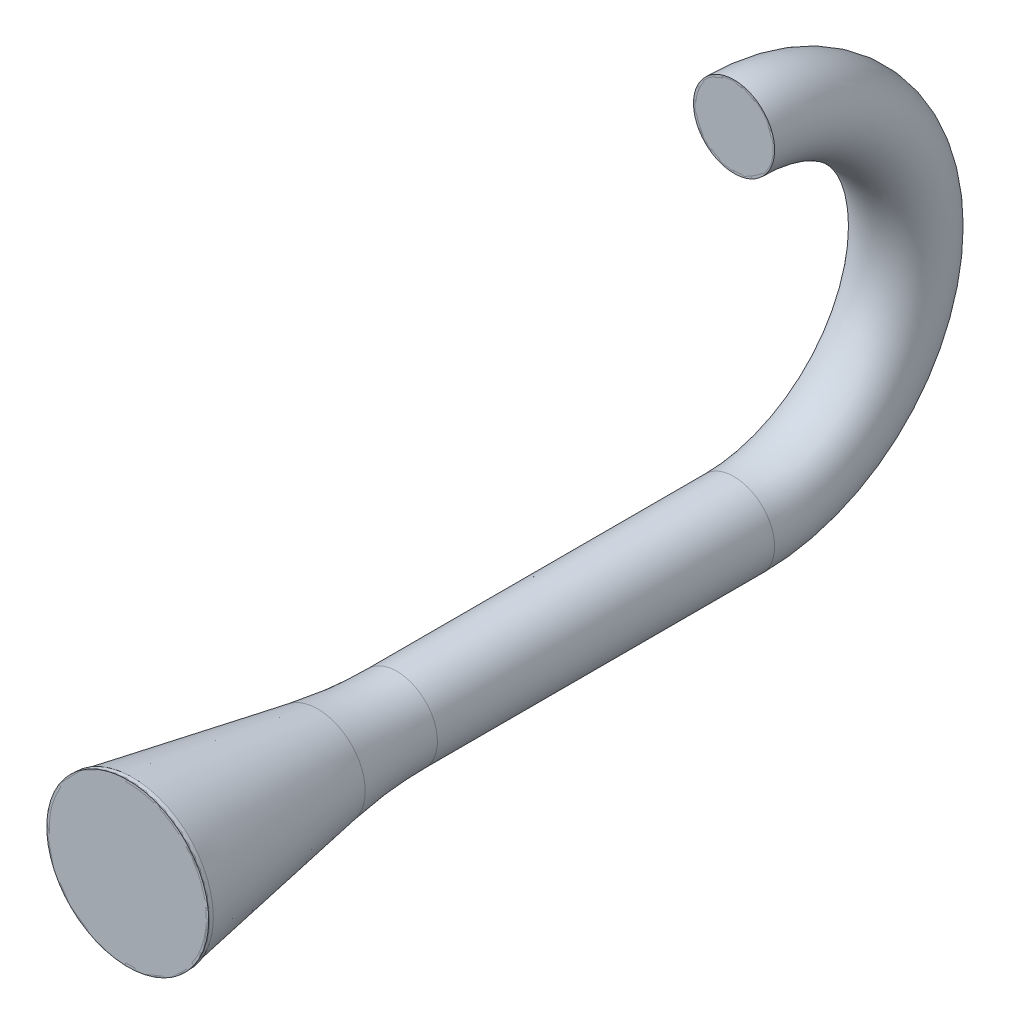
ISO-10303-21;
HEADER;
FILE_DESCRIPTION(('STEP AP214'),'2;1');
FILE_NAME('part.step','',(''),(''),'','','');
FILE_SCHEMA(('AUTOMOTIVE_DESIGN { 1 0 10303 214 1 1 1 1 }'));
ENDSEC;
DATA;
#1=APPLICATION_CONTEXT('core data for automotive mechanical design processes');
#2=APPLICATION_PROTOCOL_DEFINITION('international standard','automotive_design',2000,#1);
#3=PRODUCT_CONTEXT('',#1,'mechanical');
#4=PRODUCT('Part','Part','',(#3));
#5=PRODUCT_RELATED_PRODUCT_CATEGORY('part','',(#4));
#6=PRODUCT_DEFINITION_FORMATION('','',#4);
#7=PRODUCT_DEFINITION_CONTEXT('part definition',#1,'design');
#8=PRODUCT_DEFINITION('design','',#6,#7);
#9=PRODUCT_DEFINITION_SHAPE('','',#8);
#10=(LENGTH_UNIT() NAMED_UNIT(*) SI_UNIT(.MILLI.,.METRE.));
#11=(NAMED_UNIT(*) PLANE_ANGLE_UNIT() SI_UNIT($,.RADIAN.));
#12=(NAMED_UNIT(*) SI_UNIT($,.STERADIAN.) SOLID_ANGLE_UNIT());
#13=UNCERTAINTY_MEASURE_WITH_UNIT(LENGTH_MEASURE(1.E-05),#10,'distance_accuracy_value','');
#14=(GEOMETRIC_REPRESENTATION_CONTEXT(3) GLOBAL_UNCERTAINTY_ASSIGNED_CONTEXT((#13)) GLOBAL_UNIT_ASSIGNED_CONTEXT((#10,
#11,#12)) REPRESENTATION_CONTEXT('',''));
#15=CARTESIAN_POINT('',(0.,0.,0.));
#16=DIRECTION('',(0.,0.,1.));
#17=DIRECTION('',(1.,0.,0.));
#18=AXIS2_PLACEMENT_3D('',#15,#16,#17);
#19=CARTESIAN_POINT('',(0.,-114.3,0.));
#20=DIRECTION('',(0.,0.,1.));
#21=DIRECTION('',(1.,0.,0.));
#22=AXIS2_PLACEMENT_3D('',#19,#20,#21);
#23=CYLINDRICAL_SURFACE('',#22,25.4);
#24=DIRECTION('',(0.,0.,1.));
#25=VECTOR('',#24,1.);
#26=CARTESIAN_POINT('',(25.4,-114.3,221.338890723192));
#27=LINE('',#26,#25);
#28=CARTESIAN_POINT('',(25.4,-114.3,221.338890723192));
#29=VERTEX_POINT('',#28);
#30=CARTESIAN_POINT('',(25.4,-114.3,224.338890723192));
#31=VERTEX_POINT('',#30);
#32=EDGE_CURVE('P0_E87',#29,#31,#27,.T.);
#33=ORIENTED_EDGE('',*,*,#32,.F.);
#34=CARTESIAN_POINT('',(0.,-114.3,221.338890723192));
#35=DIRECTION('',(0.,0.,1.));
#36=DIRECTION('',(1.,0.,0.));
#37=AXIS2_PLACEMENT_3D('',#34,#35,#36);
#38=CIRCLE('',#37,25.4);
#39=CARTESIAN_POINT('',(-25.4,-114.3,221.338890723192));
#40=VERTEX_POINT('',#39);
#41=EDGE_CURVE('P0_E91',#29,#40,#38,.T.);
#42=ORIENTED_EDGE('',*,*,#41,.T.);
#43=DIRECTION('',(0.,0.,1.));
#44=VECTOR('',#43,1.);
#45=CARTESIAN_POINT('',(-25.4,-114.3,221.338890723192));
#46=LINE('',#45,#44);
#47=CARTESIAN_POINT('',(-25.4,-114.3,224.338890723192));
#48=VERTEX_POINT('',#47);
#49=EDGE_CURVE('P0_E78',#40,#48,#46,.T.);
#50=ORIENTED_EDGE('',*,*,#49,.T.);
#51=CARTESIAN_POINT('',(0.,-114.3,224.338890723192));
#52=DIRECTION('',(0.,0.,1.));
#53=DIRECTION('',(1.,0.,0.));
#54=AXIS2_PLACEMENT_3D('',#51,#52,#53);
#55=CIRCLE('',#54,25.4);
#56=EDGE_CURVE('P0_E124',#31,#48,#55,.F.);
#57=ORIENTED_EDGE('',*,*,#56,.F.);
#58=EDGE_LOOP('',(#33,#42,#50,#57));
#59=FACE_BOUND('',#58,.T.);
#60=CARTESIAN_POINT('',(0.,-114.3,0.));
#61=DIRECTION('',(0.,0.,-1.));
#62=DIRECTION('',(1.,0.,0.));
#63=AXIS2_PLACEMENT_3D('',#60,#61,#62);
#64=CIRCLE('',#63,25.4);
#65=CARTESIAN_POINT('',(-15.6575860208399,-94.3,0.));
#66=VERTEX_POINT('',#65);
#67=CARTESIAN_POINT('',(15.6575860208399,-94.3,0.));
#68=VERTEX_POINT('',#67);
#69=EDGE_CURVE('P0_E118',#66,#68,#64,.T.);
#70=ORIENTED_EDGE('',*,*,#69,.T.);
#71=DIRECTION('',(0.,0.,-1.));
#72=VECTOR('',#71,1.);
#73=CARTESIAN_POINT('',(15.6575860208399,-94.3,10.));
#74=LINE('',#73,#72);
#75=CARTESIAN_POINT('',(15.6575860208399,-94.3,10.));
#76=VERTEX_POINT('',#75);
#77=EDGE_CURVE('P0_E58',#76,#68,#74,.T.);
#78=ORIENTED_EDGE('',*,*,#77,.F.);
#79=CARTESIAN_POINT('',(0.,-114.3,10.));
#80=DIRECTION('',(0.,0.,1.));
#81=DIRECTION('',(1.,0.,0.));
#82=AXIS2_PLACEMENT_3D('',#79,#80,#81);
#83=CIRCLE('',#82,25.4);
#84=CARTESIAN_POINT('',(-15.6575860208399,-94.3,10.));
#85=VERTEX_POINT('',#84);
#86=EDGE_CURVE('P0_E100',#85,#76,#83,.T.);
#87=ORIENTED_EDGE('',*,*,#86,.F.);
#88=DIRECTION('',(0.,0.,-1.));
#89=VECTOR('',#88,1.);
#90=CARTESIAN_POINT('',(-15.6575860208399,-94.3,10.));
#91=LINE('',#90,#89);
#92=EDGE_CURVE('P0_E106',#85,#66,#91,.T.);
#93=ORIENTED_EDGE('',*,*,#92,.T.);
#94=EDGE_LOOP('',(#70,#78,#87,#93));
#95=FACE_BOUND('',#94,.T.);
#96=ADVANCED_FACE('P0_F34',(#59,#95),#23,.F.);
#97=CARTESIAN_POINT('',(0.,-114.3,0.));
#98=DIRECTION('',(0.,0.,1.));
#99=DIRECTION('',(1.,0.,0.));
#100=AXIS2_PLACEMENT_3D('',#97,#98,#99);
#101=CYLINDRICAL_SURFACE('',#100,26.9875);
#102=CARTESIAN_POINT('',(0.,-114.3,224.338890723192));
#103=DIRECTION('',(0.,0.,1.));
#104=DIRECTION('',(1.,0.,0.));
#105=AXIS2_PLACEMENT_3D('',#102,#103,#104);
#106=CIRCLE('',#105,26.9875);
#107=CARTESIAN_POINT('',(26.9875,-114.3,224.338890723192));
#108=VERTEX_POINT('',#107);
#109=EDGE_CURVE('P0_E11',#108,#108,#106,.F.);
#110=ORIENTED_EDGE('',*,*,#109,.T.);
#111=EDGE_LOOP('',(#110));
#112=FACE_BOUND('',#111,.T.);
#113=CARTESIAN_POINT('',(0.,-114.3,0.));
#114=DIRECTION('',(0.,0.,1.));
#115=DIRECTION('',(0.,-1.,0.));
#116=AXIS2_PLACEMENT_3D('',#113,#114,#115);
#117=CIRCLE('',#116,26.9875);
#118=CARTESIAN_POINT('',(0.,-141.2875,0.));
#119=VERTEX_POINT('',#118);
#120=EDGE_CURVE('P0_E126',#119,#119,#117,.F.);
#121=ORIENTED_EDGE('',*,*,#120,.F.);
#122=EDGE_LOOP('',(#121));
#123=FACE_BOUND('',#122,.T.);
#124=ADVANCED_FACE('P0_F154',(#112,#123),#101,.T.);
#125=CARTESIAN_POINT('',(0.,0.,0.));
#126=DIRECTION('',(1.,0.,0.));
#127=DIRECTION('',(0.,0.,-1.));
#128=AXIS2_PLACEMENT_3D('',#125,#126,#127);
#129=TOROIDAL_SURFACE('',#128,114.3,26.9875);
#130=CARTESIAN_POINT('',(0.,114.3,0.));
#131=DIRECTION('',(0.,0.,1.));
#132=DIRECTION('',(1.,0.,0.));
#133=AXIS2_PLACEMENT_3D('',#130,#131,#132);
#134=CIRCLE('',#133,26.9875);
#135=CARTESIAN_POINT('',(0.,141.2875,0.));
#136=VERTEX_POINT('',#135);
#137=EDGE_CURVE('P0_E129',#136,#136,#134,.T.);
#138=CARTESIAN_POINT('',(0.,0.,0.));
#139=DIRECTION('',(1.,0.,0.));
#140=DIRECTION('',(0.,0.,-1.));
#141=AXIS2_PLACEMENT_3D('',#138,#139,#140);
#142=CIRCLE('',#141,141.2875);
#143=EDGE_CURVE('',#119,#136,#142,.T.);
#144=ORIENTED_EDGE('',*,*,#120,.T.);
#145=ORIENTED_EDGE('',*,*,#137,.F.);
#146=ORIENTED_EDGE('',*,*,#143,.T.);
#147=ORIENTED_EDGE('',*,*,#143,.F.);
#148=EDGE_LOOP('',(#144,#146,#145,#147));
#149=FACE_BOUND('',#148,.T.);
#150=ADVANCED_FACE('P0_F149',(#149),#129,.T.);
#151=CARTESIAN_POINT('',(0.,114.3,0.));
#152=DIRECTION('',(0.,0.,1.));
#153=DIRECTION('',(1.,0.,0.));
#154=AXIS2_PLACEMENT_3D('',#151,#152,#153);
#155=PLANE('',#154);
#156=CARTESIAN_POINT('',(0.,114.3,0.));
#157=DIRECTION('',(0.,0.,1.));
#158=DIRECTION('',(1.,0.,0.));
#159=AXIS2_PLACEMENT_3D('',#156,#157,#158);
#160=CIRCLE('',#159,25.4);
#161=CARTESIAN_POINT('',(25.4,114.3,0.));
#162=VERTEX_POINT('',#161);
#163=EDGE_CURVE('P0_E115',#162,#162,#160,.T.);
#164=ORIENTED_EDGE('',*,*,#163,.F.);
#165=EDGE_LOOP('',(#164));
#166=FACE_BOUND('',#165,.T.);
#167=ORIENTED_EDGE('',*,*,#137,.T.);
#168=EDGE_LOOP('',(#167));
#169=FACE_BOUND('',#168,.T.);
#170=ADVANCED_FACE('P0_F141',(#166,#169),#155,.T.);
#171=CARTESIAN_POINT('',(0.,-114.3,250.729768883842));
#172=DIRECTION('',(0.,0.,1.));
#173=DIRECTION('',(1.,0.,0.));
#174=AXIS2_PLACEMENT_3D('',#171,#172,#173);
#175=CONICAL_SURFACE('',#174,26.9633823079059,0.174532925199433);
#176=CARTESIAN_POINT('',(0.,-114.3,276.991188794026));
#177=DIRECTION('',(0.,0.,1.));
#178=DIRECTION('',(1.,0.,0.));
#179=AXIS2_PLACEMENT_3D('',#176,#177,#178);
#180=CIRCLE('',#179,31.5939791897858);
#181=CARTESIAN_POINT('',(31.5939791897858,-114.3,276.991188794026));
#182=VERTEX_POINT('',#181);
#183=EDGE_CURVE('P0_E43',#182,#182,#180,.T.);
#184=ORIENTED_EDGE('',*,*,#183,.T.);
#185=EDGE_LOOP('',(#184));
#186=FACE_BOUND('',#185,.T.);
#187=CARTESIAN_POINT('',(0.,-114.3,403.405435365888));
#188=DIRECTION('',(0.,0.,1.));
#189=DIRECTION('',(1.,0.,0.));
#190=AXIS2_PLACEMENT_3D('',#187,#188,#189);
#191=CIRCLE('',#190,53.8842216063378);
#192=CARTESIAN_POINT('',(53.8842216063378,-114.3,403.405435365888));
#193=VERTEX_POINT('',#192);
#194=EDGE_CURVE('P0_E38',#193,#193,#191,.T.);
#195=ORIENTED_EDGE('',*,*,#194,.F.);
#196=EDGE_LOOP('',(#195));
#197=FACE_BOUND('',#196,.T.);
#198=ADVANCED_FACE('P0_F139',(#186,#197),#175,.T.);
#199=CARTESIAN_POINT('',(0.,-114.3,403.405435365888));
#200=DIRECTION('',(0.,0.,1.));
#201=DIRECTION('',(1.,0.,0.));
#202=AXIS2_PLACEMENT_3D('',#199,#200,#201);
#203=PLANE('',#202);
#204=CARTESIAN_POINT('',(0.,-114.3,403.405435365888));
#205=DIRECTION('',(0.,0.,1.));
#206=DIRECTION('',(1.,0.,0.));
#207=AXIS2_PLACEMENT_3D('',#204,#205,#206);
#208=CIRCLE('',#207,52.2722318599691);
#209=CARTESIAN_POINT('',(52.2722318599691,-114.3,403.405435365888));
#210=VERTEX_POINT('',#209);
#211=EDGE_CURVE('P0_E112',#210,#210,#208,.T.);
#212=ORIENTED_EDGE('',*,*,#211,.F.);
#213=EDGE_LOOP('',(#212));
#214=FACE_BOUND('',#213,.T.);
#215=ORIENTED_EDGE('',*,*,#194,.T.);
#216=EDGE_LOOP('',(#215));
#217=FACE_BOUND('',#216,.T.);
#218=ADVANCED_FACE('P0_F137',(#214,#217),#203,.T.);
#219=CARTESIAN_POINT('',(0.,-114.3,224.338890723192));
#220=DIRECTION('',(0.,0.,1.));
#221=DIRECTION('',(1.,0.,0.));
#222=AXIS2_PLACEMENT_3D('',#219,#220,#221);
#223=TOROIDAL_SURFACE('',#222,330.2,303.2125);
#224=ORIENTED_EDGE('',*,*,#109,.F.);
#225=EDGE_LOOP('',(#224));
#226=FACE_BOUND('',#225,.T.);
#227=ORIENTED_EDGE('',*,*,#183,.F.);
#228=EDGE_LOOP('',(#227));
#229=FACE_BOUND('',#228,.T.);
#230=ADVANCED_FACE('P0_F36',(#226,#229),#223,.F.);
#231=CARTESIAN_POINT('',(0.,0.,0.));
#232=DIRECTION('',(1.,0.,0.));
#233=DIRECTION('',(0.,0.,-1.));
#234=AXIS2_PLACEMENT_3D('',#231,#232,#233);
#235=TOROIDAL_SURFACE('',#234,114.3,25.4);
#236=EDGE_CURVE('P0_E119',#68,#66,#64,.T.);
#237=ORIENTED_EDGE('',*,*,#236,.F.);
#238=ORIENTED_EDGE('',*,*,#69,.F.);
#239=EDGE_LOOP('',(#237,#238));
#240=FACE_BOUND('',#239,.T.);
#241=ORIENTED_EDGE('',*,*,#163,.T.);
#242=EDGE_LOOP('',(#241));
#243=FACE_BOUND('',#242,.T.);
#244=ADVANCED_FACE('P0_F163',(#240,#243),#235,.F.);
#245=CARTESIAN_POINT('',(0.,-114.3,251.005435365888));
#246=DIRECTION('',(0.,0.,1.));
#247=DIRECTION('',(1.,0.,0.));
#248=AXIS2_PLACEMENT_3D('',#245,#246,#247);
#249=CONICAL_SURFACE('',#248,25.399999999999,0.174532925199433);
#250=CARTESIAN_POINT('',(0.,-114.3,277.266855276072));
#251=DIRECTION('',(0.,0.,1.));
#252=DIRECTION('',(1.,0.,0.));
#253=AXIS2_PLACEMENT_3D('',#250,#251,#252);
#254=CIRCLE('',#253,30.030596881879);
#255=CARTESIAN_POINT('',(30.030596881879,-114.3,277.266855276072));
#256=VERTEX_POINT('',#255);
#257=EDGE_CURVE('P0_E121',#256,#256,#254,.T.);
#258=ORIENTED_EDGE('',*,*,#257,.F.);
#259=EDGE_LOOP('',(#258));
#260=FACE_BOUND('',#259,.T.);
#261=ORIENTED_EDGE('',*,*,#211,.T.);
#262=EDGE_LOOP('',(#261));
#263=FACE_BOUND('',#262,.T.);
#264=ADVANCED_FACE('P0_F168',(#260,#263),#249,.F.);
#265=CARTESIAN_POINT('',(0.,-114.3,224.338890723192));
#266=DIRECTION('',(0.,0.,1.));
#267=DIRECTION('',(1.,0.,0.));
#268=AXIS2_PLACEMENT_3D('',#265,#266,#267);
#269=TOROIDAL_SURFACE('',#268,330.2,304.8);
#270=ORIENTED_EDGE('',*,*,#56,.T.);
#271=CARTESIAN_POINT('',(0.,-114.3,224.338890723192));
#272=DIRECTION('',(0.,0.,1.));
#273=DIRECTION('',(1.,0.,0.));
#274=AXIS2_PLACEMENT_3D('',#271,#272,#273);
#275=CIRCLE('',#274,25.4);
#276=EDGE_CURVE('P0_E94',#31,#48,#275,.T.);
#277=ORIENTED_EDGE('',*,*,#276,.F.);
#278=EDGE_LOOP('',(#270,#277));
#279=FACE_BOUND('',#278,.T.);
#280=ORIENTED_EDGE('',*,*,#257,.T.);
#281=EDGE_LOOP('',(#280));
#282=FACE_BOUND('',#281,.T.);
#283=ADVANCED_FACE('P0_F165',(#279,#282),#269,.T.);
#284=CARTESIAN_POINT('',(-15.6575860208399,-94.3,10.));
#285=DIRECTION('',(0.,-1.,0.));
#286=DIRECTION('',(0.,0.,-1.));
#287=AXIS2_PLACEMENT_3D('',#284,#285,#286);
#288=PLANE('',#287);
#289=DIRECTION('',(-1.,0.,0.));
#290=VECTOR('',#289,1.);
#291=CARTESIAN_POINT('',(-15.6575860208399,-94.3,0.));
#292=LINE('',#291,#290);
#293=EDGE_CURVE('P0_E98',#68,#66,#292,.T.);
#294=ORIENTED_EDGE('',*,*,#293,.T.);
#295=ORIENTED_EDGE('',*,*,#92,.F.);
#296=DIRECTION('',(-1.,0.,0.));
#297=VECTOR('',#296,1.);
#298=CARTESIAN_POINT('',(-15.6575860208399,-94.3,10.));
#299=LINE('',#298,#297);
#300=EDGE_CURVE('P0_E103',#76,#85,#299,.T.);
#301=ORIENTED_EDGE('',*,*,#300,.F.);
#302=ORIENTED_EDGE('',*,*,#77,.T.);
#303=EDGE_LOOP('',(#294,#295,#301,#302));
#304=FACE_BOUND('',#303,.T.);
#305=ADVANCED_FACE('P0_F167',(#304),#288,.F.);
#306=CARTESIAN_POINT('',(0.,-114.3,10.));
#307=DIRECTION('',(0.,0.,1.));
#308=DIRECTION('',(1.,0.,0.));
#309=AXIS2_PLACEMENT_3D('',#306,#307,#308);
#310=PLANE('',#309);
#311=ORIENTED_EDGE('',*,*,#86,.T.);
#312=ORIENTED_EDGE('',*,*,#300,.T.);
#313=EDGE_LOOP('',(#311,#312));
#314=FACE_BOUND('',#313,.T.);
#315=ADVANCED_FACE('P0_F229',(#314),#310,.T.);
#316=CARTESIAN_POINT('',(0.,-114.3,0.));
#317=DIRECTION('',(0.,0.,1.));
#318=DIRECTION('',(1.,0.,0.));
#319=AXIS2_PLACEMENT_3D('',#316,#317,#318);
#320=PLANE('',#319);
#321=ORIENTED_EDGE('',*,*,#236,.T.);
#322=ORIENTED_EDGE('',*,*,#293,.F.);
#323=EDGE_LOOP('',(#321,#322));
#324=FACE_BOUND('',#323,.T.);
#325=ADVANCED_FACE('P0_F239',(#324),#320,.F.);
#326=CARTESIAN_POINT('',(-25.4,-114.3,221.338890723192));
#327=DIRECTION('',(0.,-1.,0.));
#328=DIRECTION('',(0.,0.,-1.));
#329=AXIS2_PLACEMENT_3D('',#326,#327,#328);
#330=PLANE('',#329);
#331=DIRECTION('',(1.,0.,0.));
#332=VECTOR('',#331,1.);
#333=CARTESIAN_POINT('',(-25.4,-114.3,224.338890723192));
#334=LINE('',#333,#332);
#335=EDGE_CURVE('P0_E50',#48,#31,#334,.T.);
#336=ORIENTED_EDGE('',*,*,#335,.F.);
#337=ORIENTED_EDGE('',*,*,#49,.F.);
#338=DIRECTION('',(1.,0.,0.));
#339=VECTOR('',#338,1.);
#340=CARTESIAN_POINT('',(-25.4,-114.3,221.338890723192));
#341=LINE('',#340,#339);
#342=EDGE_CURVE('P0_E81',#40,#29,#341,.T.);
#343=ORIENTED_EDGE('',*,*,#342,.T.);
#344=ORIENTED_EDGE('',*,*,#32,.T.);
#345=EDGE_LOOP('',(#336,#337,#343,#344));
#346=FACE_BOUND('',#345,.T.);
#347=ADVANCED_FACE('P0_F80',(#346),#330,.T.);
#348=CARTESIAN_POINT('',(0.,-114.3,221.338890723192));
#349=DIRECTION('',(0.,0.,1.));
#350=DIRECTION('',(1.,0.,0.));
#351=AXIS2_PLACEMENT_3D('',#348,#349,#350);
#352=PLANE('',#351);
#353=ORIENTED_EDGE('',*,*,#41,.F.);
#354=ORIENTED_EDGE('',*,*,#342,.F.);
#355=EDGE_LOOP('',(#353,#354));
#356=FACE_BOUND('',#355,.T.);
#357=ADVANCED_FACE('P0_F90',(#356),#352,.F.);
#358=CARTESIAN_POINT('',(0.,-114.3,224.338890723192));
#359=DIRECTION('',(0.,0.,1.));
#360=DIRECTION('',(1.,0.,0.));
#361=AXIS2_PLACEMENT_3D('',#358,#359,#360);
#362=PLANE('',#361);
#363=ORIENTED_EDGE('',*,*,#276,.T.);
#364=ORIENTED_EDGE('',*,*,#335,.T.);
#365=EDGE_LOOP('',(#363,#364));
#366=FACE_BOUND('',#365,.T.);
#367=ADVANCED_FACE('P0_F277',(#366),#362,.T.);
#368=CLOSED_SHELL('',(#96,#124,#150,#170,#198,#218,#230,#244,#264,#283,#305,#315,#325,#347,#357,#367));
#369=MANIFOLD_SOLID_BREP('P0_B2',#368);
#370=CARTESIAN_POINT('',(26.1184204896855,114.3,-3.17835325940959));
#371=CARTESIAN_POINT('',(26.1184204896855,116.009432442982,-3.17835325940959));
#372=CARTESIAN_POINT('',(25.7816916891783,119.428297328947,-3.17835325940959));
#373=CARTESIAN_POINT('',(24.2858225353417,124.359517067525,-3.17835325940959));
#374=CARTESIAN_POINT('',(21.8566628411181,128.90415520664,-3.17835325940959));
#375=CARTESIAN_POINT('',(18.587563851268,132.887563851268,-3.17835325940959));
#376=CARTESIAN_POINT('',(14.6041552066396,136.156662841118,-3.17835325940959));
#377=CARTESIAN_POINT('',(10.0595170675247,138.585822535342,-3.17835325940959));
#378=CARTESIAN_POINT('',(5.12829732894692,140.081691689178,-3.17835325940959));
#379=CARTESIAN_POINT('',(0.,140.586784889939,-3.17835325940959));
#380=CARTESIAN_POINT('',(-5.12829732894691,140.081691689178,-3.17835325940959));
#381=CARTESIAN_POINT('',(-10.0595170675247,138.585822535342,-3.17835325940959));
#382=CARTESIAN_POINT('',(-14.6041552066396,136.156662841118,-3.17835325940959));
#383=CARTESIAN_POINT('',(-18.587563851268,132.887563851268,-3.17835325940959));
#384=CARTESIAN_POINT('',(-21.8566628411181,128.90415520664,-3.17835325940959));
#385=CARTESIAN_POINT('',(-24.2858225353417,124.359517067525,-3.17835325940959));
#386=CARTESIAN_POINT('',(-25.7816916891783,119.428297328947,-3.17835325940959));
#387=CARTESIAN_POINT('',(-26.2867848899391,114.3,-3.17835325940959));
#388=CARTESIAN_POINT('',(-25.7816916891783,109.171702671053,-3.17835325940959));
#389=CARTESIAN_POINT('',(-24.2858225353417,104.240482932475,-3.17835325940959));
#390=CARTESIAN_POINT('',(-21.8566628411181,99.6958447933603,-3.17835325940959));
#391=CARTESIAN_POINT('',(-18.587563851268,95.712436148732,-3.17835325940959));
#392=CARTESIAN_POINT('',(-14.6041552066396,92.4433371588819,-3.17835325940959));
#393=CARTESIAN_POINT('',(-10.0595170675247,90.0141774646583,-3.17835325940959));
#394=CARTESIAN_POINT('',(-5.12829732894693,88.5183083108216,-3.17835325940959));
#395=CARTESIAN_POINT('',(0.,88.0132151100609,-3.17835325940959));
#396=CARTESIAN_POINT('',(5.12829732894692,88.5183083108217,-3.17835325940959));
#397=CARTESIAN_POINT('',(10.0595170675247,90.0141774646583,-3.17835325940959));
#398=CARTESIAN_POINT('',(14.6041552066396,92.4433371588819,-3.17835325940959));
#399=CARTESIAN_POINT('',(18.587563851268,95.7124361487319,-3.17835325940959));
#400=CARTESIAN_POINT('',(21.8566628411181,99.6958447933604,-3.17835325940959));
#401=CARTESIAN_POINT('',(24.2858225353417,104.240482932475,-3.17835325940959));
#402=CARTESIAN_POINT('',(25.7816916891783,109.171702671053,-3.17835325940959));
#403=CARTESIAN_POINT('',(26.1184204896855,112.590567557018,-3.17835325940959));
#404=CARTESIAN_POINT('',(26.1184204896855,114.3,-3.17835325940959));
#405=B_SPLINE_CURVE_WITH_KNOTS('',3,(#370,#371,#372,#373,#374,#375,#376,#377,#378,#379,#380,
#381,#382,#383,#384,#385,#386,#387,#388,#389,#390,#391,#392,#393,#394,#395,#396,#397,#398,#399,
#400,#401,#402,#403,#404),.UNSPECIFIED.,.T.,.F.,(4,1,1,1,1,1,1,1,1,1,1,1,1,1,1,1,1,1,1,1,1,1,1,
1,1,1,1,1,1,1,1,1,4),(0.,0.03125,0.0625,0.0937500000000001,0.125,0.15625,0.1875,0.21875,0.25,
0.28125,0.3125,0.34375,0.375,0.40625,0.4375,0.46875,0.5,0.53125,0.5625,0.59375,0.625,0.65625,
0.6875,0.71875,0.75,0.78125,0.8125,0.84375,0.875,0.90625,0.9375,0.96875,1.),.UNSPECIFIED.);
#406=DIRECTION('',(0.,0.,1.));
#407=VECTOR('',#406,1.);
#408=SURFACE_OF_LINEAR_EXTRUSION('',#405,#407);
#409=CARTESIAN_POINT('',(26.1184204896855,114.3,-3.17835325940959));
#410=CARTESIAN_POINT('',(26.1184204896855,116.009432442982,-3.17835325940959));
#411=CARTESIAN_POINT('',(25.7816916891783,119.428297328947,-3.17835325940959));
#412=CARTESIAN_POINT('',(24.2858225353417,124.359517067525,-3.17835325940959));
#413=CARTESIAN_POINT('',(21.8566628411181,128.90415520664,-3.17835325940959));
#414=CARTESIAN_POINT('',(18.587563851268,132.887563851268,-3.17835325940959));
#415=CARTESIAN_POINT('',(14.6041552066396,136.156662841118,-3.17835325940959));
#416=CARTESIAN_POINT('',(10.0595170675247,138.585822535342,-3.17835325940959));
#417=CARTESIAN_POINT('',(5.12829732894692,140.081691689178,-3.17835325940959));
#418=CARTESIAN_POINT('',(0.,140.586784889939,-3.17835325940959));
#419=CARTESIAN_POINT('',(-5.12829732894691,140.081691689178,-3.17835325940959));
#420=CARTESIAN_POINT('',(-10.0595170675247,138.585822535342,-3.17835325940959));
#421=CARTESIAN_POINT('',(-14.6041552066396,136.156662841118,-3.17835325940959));
#422=CARTESIAN_POINT('',(-18.587563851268,132.887563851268,-3.17835325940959));
#423=CARTESIAN_POINT('',(-21.8566628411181,128.90415520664,-3.17835325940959));
#424=CARTESIAN_POINT('',(-24.2858225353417,124.359517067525,-3.17835325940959));
#425=CARTESIAN_POINT('',(-25.7816916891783,119.428297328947,-3.17835325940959));
#426=CARTESIAN_POINT('',(-26.2867848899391,114.3,-3.17835325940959));
#427=CARTESIAN_POINT('',(-25.7816916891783,109.171702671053,-3.17835325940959));
#428=CARTESIAN_POINT('',(-24.2858225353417,104.240482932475,-3.17835325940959));
#429=CARTESIAN_POINT('',(-21.8566628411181,99.6958447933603,-3.17835325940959));
#430=CARTESIAN_POINT('',(-18.587563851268,95.712436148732,-3.17835325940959));
#431=CARTESIAN_POINT('',(-14.6041552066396,92.4433371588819,-3.17835325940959));
#432=CARTESIAN_POINT('',(-10.0595170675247,90.0141774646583,-3.17835325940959));
#433=CARTESIAN_POINT('',(-5.12829732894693,88.5183083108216,-3.17835325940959));
#434=CARTESIAN_POINT('',(0.,88.0132151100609,-3.17835325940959));
#435=CARTESIAN_POINT('',(5.12829732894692,88.5183083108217,-3.17835325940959));
#436=CARTESIAN_POINT('',(10.0595170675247,90.0141774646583,-3.17835325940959));
#437=CARTESIAN_POINT('',(14.6041552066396,92.4433371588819,-3.17835325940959));
#438=CARTESIAN_POINT('',(18.587563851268,95.7124361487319,-3.17835325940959));
#439=CARTESIAN_POINT('',(21.8566628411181,99.6958447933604,-3.17835325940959));
#440=CARTESIAN_POINT('',(24.2858225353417,104.240482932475,-3.17835325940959));
#441=CARTESIAN_POINT('',(25.7816916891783,109.171702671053,-3.17835325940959));
#442=CARTESIAN_POINT('',(26.1184204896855,112.590567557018,-3.17835325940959));
#443=CARTESIAN_POINT('',(26.1184204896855,114.3,-3.17835325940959));
#444=B_SPLINE_CURVE_WITH_KNOTS('',3,(#409,#410,#411,#412,#413,#414,#415,#416,#417,#418,#419,
#420,#421,#422,#423,#424,#425,#426,#427,#428,#429,#430,#431,#432,#433,#434,#435,#436,#437,#438,
#439,#440,#441,#442,#443),.UNSPECIFIED.,.T.,.F.,(4,1,1,1,1,1,1,1,1,1,1,1,1,1,1,1,1,1,1,1,1,1,1,
1,1,1,1,1,1,1,1,1,4),(0.,0.03125,0.0625,0.0937500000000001,0.125,0.15625,0.1875,0.21875,0.25,
0.28125,0.3125,0.34375,0.375,0.40625,0.4375,0.46875,0.5,0.53125,0.5625,0.59375,0.625,0.65625,
0.6875,0.71875,0.75,0.78125,0.8125,0.84375,0.875,0.90625,0.9375,0.96875,1.),.UNSPECIFIED.);
#445=CARTESIAN_POINT('',(26.1184204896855,114.3,-3.17835325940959));
#446=VERTEX_POINT('',#445);
#447=EDGE_CURVE('P1_E9',#446,#446,#444,.T.);
#448=ORIENTED_EDGE('',*,*,#447,.T.);
#449=EDGE_LOOP('',(#448));
#450=FACE_BOUND('',#449,.T.);
#451=CARTESIAN_POINT('',(26.1184204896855,114.3,0.));
#452=CARTESIAN_POINT('',(26.1184204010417,113.872639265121,0.));
#453=CARTESIAN_POINT('',(26.1078975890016,113.445281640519,0.));
#454=CARTESIAN_POINT('',(26.0659076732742,112.591592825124,0.));
#455=CARTESIAN_POINT('',(26.0344404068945,112.16526164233,0.));
#456=CARTESIAN_POINT('',(25.9506627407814,111.314652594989,0.));
#457=CARTESIAN_POINT('',(25.898352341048,110.890374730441,0.));
#458=CARTESIAN_POINT('',(25.7729888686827,110.044896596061,0.));
#459=CARTESIAN_POINT('',(25.6999359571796,109.623696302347,0.));
#460=CARTESIAN_POINT('',(25.5331887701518,108.785401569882,0.));
#461=CARTESIAN_POINT('',(25.4394944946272,108.368307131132,0.));
#462=CARTESIAN_POINT('',(25.2317647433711,107.539212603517,0.));
#463=CARTESIAN_POINT('',(25.1177291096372,107.127212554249,0.));
#464=CARTESIAN_POINT('',(24.8696156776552,106.309292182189,0.));
#465=CARTESIAN_POINT('',(24.7355378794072,105.903371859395,0.));
#466=CARTESIAN_POINT('',(24.4476386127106,105.098596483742,0.));
#467=CARTESIAN_POINT('',(24.2938172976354,104.699741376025,0.));
#468=CARTESIAN_POINT('',(23.9667309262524,103.91008502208,0.));
#469=CARTESIAN_POINT('',(23.7934658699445,103.519283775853,0.));
#470=CARTESIAN_POINT('',(23.4279792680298,102.746646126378,0.));
#471=CARTESIAN_POINT('',(23.2357575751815,102.364809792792,0.));
#472=CARTESIAN_POINT('',(22.8328432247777,101.611010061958,0.));
#473=CARTESIAN_POINT('',(22.6221505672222,101.239046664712,0.));
#474=CARTESIAN_POINT('',(22.1827793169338,100.505901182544,0.));
#475=CARTESIAN_POINT('',(21.9541008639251,100.144719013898,0.));
#476=CARTESIAN_POINT('',(21.4792450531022,99.4340470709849,0.));
#477=CARTESIAN_POINT('',(21.2330676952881,99.0845572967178,0.));
#478=CARTESIAN_POINT('',(20.7238696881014,98.3980685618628,0.));
#479=CARTESIAN_POINT('',(20.460848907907,98.0610696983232,0.));
#480=CARTESIAN_POINT('',(19.9186174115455,97.4003587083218,0.));
#481=CARTESIAN_POINT('',(19.6394066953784,97.07664658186,0.));
#482=CARTESIAN_POINT('',(19.0654482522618,96.4433053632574,0.));
#483=CARTESIAN_POINT('',(18.7707006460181,96.1336761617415,0.));
#484=CARTESIAN_POINT('',(18.1663238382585,95.5292993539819,0.));
#485=CARTESIAN_POINT('',(17.8566946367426,95.2345517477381,0.));
#486=CARTESIAN_POINT('',(17.22335341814,94.6605933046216,0.));
#487=CARTESIAN_POINT('',(16.8996412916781,94.3813825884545,0.));
#488=CARTESIAN_POINT('',(16.2389303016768,93.8391510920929,0.));
#489=CARTESIAN_POINT('',(15.9019314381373,93.5761303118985,0.));
#490=CARTESIAN_POINT('',(15.2154427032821,93.0669323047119,0.));
#491=CARTESIAN_POINT('',(14.8659529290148,92.8207549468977,0.));
#492=CARTESIAN_POINT('',(14.1552809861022,92.3458991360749,0.));
#493=CARTESIAN_POINT('',(13.7940988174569,92.1172206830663,0.));
#494=CARTESIAN_POINT('',(13.0609533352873,91.6778494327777,0.));
#495=CARTESIAN_POINT('',(12.6889899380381,91.4671567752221,0.));
#496=CARTESIAN_POINT('',(11.9351902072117,91.0642424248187,0.));
#497=CARTESIAN_POINT('',(11.5533538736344,90.8720207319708,0.));
#498=CARTESIAN_POINT('',(10.7807162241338,90.5065341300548,0.));
#499=CARTESIAN_POINT('',(10.389914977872,90.3332690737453,0.));
#500=CARTESIAN_POINT('',(9.60025862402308,90.0061827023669,0.));
#501=CARTESIAN_POINT('',(9.201403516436,89.8523613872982,0.));
#502=CARTESIAN_POINT('',(8.3966281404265,89.5644621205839,0.));
#503=CARTESIAN_POINT('',(7.99070781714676,89.4303843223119,0.));
#504=CARTESIAN_POINT('',(7.17278744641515,89.1822708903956,0.));
#505=CARTESIAN_POINT('',(6.76078739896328,89.0682352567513,0.));
#506=CARTESIAN_POINT('',(5.9316928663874,88.8605055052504,0.));
#507=CARTESIAN_POINT('',(5.51459842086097,88.7668112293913,0.));
#508=CARTESIAN_POINT('',(4.67630370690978,88.6000640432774,0.));
#509=CARTESIAN_POINT('',(4.25510343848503,88.5270111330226,0.));
#510=CARTESIAN_POINT('',(3.40962523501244,88.4016476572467,0.));
#511=CARTESIAN_POINT('',(2.98534727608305,88.3493372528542,0.));
#512=CARTESIAN_POINT('',(2.13473848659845,88.2655595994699,0.));
#513=CARTESIAN_POINT('',(1.70840765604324,88.2340923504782,0.));
#514=CARTESIAN_POINT('',(0.85471787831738,88.1921023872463,0.));
#515=CARTESIAN_POINT('',(0.427358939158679,88.1815795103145,0.));
#516=CARTESIAN_POINT('',(-0.427358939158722,88.1815795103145,0.));
#517=CARTESIAN_POINT('',(-0.854717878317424,88.1921023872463,0.));
#518=CARTESIAN_POINT('',(-1.70840765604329,88.2340923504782,0.));
#519=CARTESIAN_POINT('',(-2.13473848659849,88.2655595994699,0.));
#520=CARTESIAN_POINT('',(-2.98534727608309,88.3493372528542,0.));
#521=CARTESIAN_POINT('',(-3.40962523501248,88.4016476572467,0.));
#522=CARTESIAN_POINT('',(-4.25510343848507,88.5270111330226,0.));
#523=CARTESIAN_POINT('',(-4.67630370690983,88.6000640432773,0.));
#524=CARTESIAN_POINT('',(-5.51459842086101,88.7668112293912,0.));
#525=CARTESIAN_POINT('',(-5.93169286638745,88.8605055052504,0.));
#526=CARTESIAN_POINT('',(-6.76078739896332,89.0682352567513,0.));
#527=CARTESIAN_POINT('',(-7.17278744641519,89.1822708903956,0.));
#528=CARTESIAN_POINT('',(-7.9907078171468,89.430384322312,0.));
#529=CARTESIAN_POINT('',(-8.39662814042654,89.564462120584,0.));
#530=CARTESIAN_POINT('',(-9.20140351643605,89.8523613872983,0.));
#531=CARTESIAN_POINT('',(-9.60025862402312,90.006182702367,0.));
#532=CARTESIAN_POINT('',(-10.389914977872,90.3332690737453,0.));
#533=CARTESIAN_POINT('',(-10.7807162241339,90.5065341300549,0.));
#534=CARTESIAN_POINT('',(-11.5533538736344,90.8720207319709,0.));
#535=CARTESIAN_POINT('',(-11.9351902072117,91.0642424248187,0.));
#536=CARTESIAN_POINT('',(-12.6889899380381,91.4671567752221,0.));
#537=CARTESIAN_POINT('',(-13.0609533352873,91.6778494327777,0.));
#538=CARTESIAN_POINT('',(-13.7940988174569,92.1172206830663,0.));
#539=CARTESIAN_POINT('',(-14.1552809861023,92.3458991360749,0.));
#540=CARTESIAN_POINT('',(-14.8659529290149,92.8207549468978,0.));
#541=CARTESIAN_POINT('',(-15.2154427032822,93.0669323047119,0.));
#542=CARTESIAN_POINT('',(-15.9019314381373,93.5761303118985,0.));
#543=CARTESIAN_POINT('',(-16.2389303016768,93.8391510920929,0.));
#544=CARTESIAN_POINT('',(-16.8996412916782,94.3813825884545,0.));
#545=CARTESIAN_POINT('',(-17.22335341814,94.6605933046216,0.));
#546=CARTESIAN_POINT('',(-17.8566946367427,95.2345517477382,0.));
#547=CARTESIAN_POINT('',(-18.1663238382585,95.5292993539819,0.));
#548=CARTESIAN_POINT('',(-18.7707006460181,96.1336761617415,0.));
#549=CARTESIAN_POINT('',(-19.0654482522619,96.4433053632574,0.));
#550=CARTESIAN_POINT('',(-19.6394066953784,97.07664658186,0.));
#551=CARTESIAN_POINT('',(-19.9186174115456,97.4003587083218,0.));
#552=CARTESIAN_POINT('',(-20.4608489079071,98.0610696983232,0.));
#553=CARTESIAN_POINT('',(-20.7238696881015,98.3980685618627,0.));
#554=CARTESIAN_POINT('',(-21.2330676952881,99.0845572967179,0.));
#555=CARTESIAN_POINT('',(-21.4792450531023,99.4340470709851,0.));
#556=CARTESIAN_POINT('',(-21.9541008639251,100.144719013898,0.));
#557=CARTESIAN_POINT('',(-22.1827793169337,100.505901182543,0.));
#558=CARTESIAN_POINT('',(-22.6221505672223,101.239046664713,0.));
#559=CARTESIAN_POINT('',(-22.8328432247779,101.611010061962,0.));
#560=CARTESIAN_POINT('',(-23.2357575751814,102.364809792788,0.));
#561=CARTESIAN_POINT('',(-23.4279792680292,102.746646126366,0.));
#562=CARTESIAN_POINT('',(-23.7934658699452,103.519283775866,0.));
#563=CARTESIAN_POINT('',(-23.9667309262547,103.910085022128,0.));
#564=CARTESIAN_POINT('',(-24.2938172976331,104.699741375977,0.));
#565=CARTESIAN_POINT('',(-24.4476386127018,105.098596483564,0.));
#566=CARTESIAN_POINT('',(-24.7355378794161,105.903371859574,0.));
#567=CARTESIAN_POINT('',(-24.8696156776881,106.309292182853,0.));
#568=CARTESIAN_POINT('',(-25.1177291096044,107.127212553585,0.));
#569=CARTESIAN_POINT('',(-25.2317647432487,107.539212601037,0.));
#570=CARTESIAN_POINT('',(-25.4394944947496,108.368307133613,0.));
#571=CARTESIAN_POINT('',(-25.5331887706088,108.785401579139,0.));
#572=CARTESIAN_POINT('',(-25.6999359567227,109.62369629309,0.));
#573=CARTESIAN_POINT('',(-25.7729888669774,110.044896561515,0.));
#574=CARTESIAN_POINT('',(-25.8983523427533,110.890374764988,0.));
#575=CARTESIAN_POINT('',(-25.9506627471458,111.314652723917,0.));
#576=CARTESIAN_POINT('',(-26.0344404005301,112.165261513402,0.));
#577=CARTESIAN_POINT('',(-26.0659076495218,112.591592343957,0.));
#578=CARTESIAN_POINT('',(-26.1078976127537,113.445282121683,0.));
#579=CARTESIAN_POINT('',(-26.1184204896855,113.872641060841,0.));
#580=CARTESIAN_POINT('',(-26.1184204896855,114.727358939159,0.));
#581=CARTESIAN_POINT('',(-26.1078976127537,115.154717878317,0.));
#582=CARTESIAN_POINT('',(-26.0659076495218,116.008407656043,0.));
#583=CARTESIAN_POINT('',(-26.0344404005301,116.434738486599,0.));
#584=CARTESIAN_POINT('',(-25.9506627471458,117.285347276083,0.));
#585=CARTESIAN_POINT('',(-25.8983523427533,117.709625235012,0.));
#586=CARTESIAN_POINT('',(-25.7729888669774,118.555103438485,0.));
#587=CARTESIAN_POINT('',(-25.6999359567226,118.97630370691,0.));
#588=CARTESIAN_POINT('',(-25.5331887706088,119.814598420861,0.));
#589=CARTESIAN_POINT('',(-25.4394944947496,120.231692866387,0.));
#590=CARTESIAN_POINT('',(-25.2317647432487,121.060787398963,0.));
#591=CARTESIAN_POINT('',(-25.1177291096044,121.472787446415,0.));
#592=CARTESIAN_POINT('',(-24.869615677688,122.290707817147,0.));
#593=CARTESIAN_POINT('',(-24.735537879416,122.696628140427,0.));
#594=CARTESIAN_POINT('',(-24.4476386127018,123.501403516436,0.));
#595=CARTESIAN_POINT('',(-24.293817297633,123.900258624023,0.));
#596=CARTESIAN_POINT('',(-23.9667309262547,124.689914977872,0.));
#597=CARTESIAN_POINT('',(-23.7934658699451,125.080716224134,0.));
#598=CARTESIAN_POINT('',(-23.4279792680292,125.853353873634,0.));
#599=CARTESIAN_POINT('',(-23.2357575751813,126.235190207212,0.));
#600=CARTESIAN_POINT('',(-22.8328432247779,126.988989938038,0.));
#601=CARTESIAN_POINT('',(-22.6221505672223,127.360953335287,0.));
#602=CARTESIAN_POINT('',(-22.1827793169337,128.094098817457,0.));
#603=CARTESIAN_POINT('',(-21.9541008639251,128.455280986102,0.));
#604=CARTESIAN_POINT('',(-21.4792450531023,129.165952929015,0.));
#605=CARTESIAN_POINT('',(-21.2330676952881,129.515442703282,0.));
#606=CARTESIAN_POINT('',(-20.7238696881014,130.201931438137,0.));
#607=CARTESIAN_POINT('',(-20.460848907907,130.538930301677,0.));
#608=CARTESIAN_POINT('',(-19.9186174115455,131.199641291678,0.));
#609=CARTESIAN_POINT('',(-19.6394066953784,131.52335341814,0.));
#610=CARTESIAN_POINT('',(-19.0654482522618,132.156694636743,0.));
#611=CARTESIAN_POINT('',(-18.7707006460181,132.466323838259,0.));
#612=CARTESIAN_POINT('',(-18.1663238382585,133.070700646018,0.));
#613=CARTESIAN_POINT('',(-17.8566946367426,133.365448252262,0.));
#614=CARTESIAN_POINT('',(-17.22335341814,133.939406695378,0.));
#615=CARTESIAN_POINT('',(-16.8996412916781,134.218617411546,0.));
#616=CARTESIAN_POINT('',(-16.2389303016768,134.760848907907,0.));
#617=CARTESIAN_POINT('',(-15.9019314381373,135.023869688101,0.));
#618=CARTESIAN_POINT('',(-15.2154427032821,135.533067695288,0.));
#619=CARTESIAN_POINT('',(-14.8659529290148,135.779245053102,0.));
#620=CARTESIAN_POINT('',(-14.1552809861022,136.254100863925,0.));
#621=CARTESIAN_POINT('',(-13.7940988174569,136.482779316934,0.));
#622=CARTESIAN_POINT('',(-13.0609533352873,136.922150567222,0.));
#623=CARTESIAN_POINT('',(-12.6889899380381,137.132843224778,0.));
#624=CARTESIAN_POINT('',(-11.9351902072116,137.535757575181,0.));
#625=CARTESIAN_POINT('',(-11.5533538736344,137.727979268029,0.));
#626=CARTESIAN_POINT('',(-10.7807162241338,138.093465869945,0.));
#627=CARTESIAN_POINT('',(-10.389914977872,138.266730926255,0.));
#628=CARTESIAN_POINT('',(-9.60025862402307,138.593817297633,0.));
#629=CARTESIAN_POINT('',(-9.201403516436,138.747638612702,0.));
#630=CARTESIAN_POINT('',(-8.39662814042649,139.035537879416,0.));
#631=CARTESIAN_POINT('',(-7.99070781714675,139.169615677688,0.));
#632=CARTESIAN_POINT('',(-7.17278744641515,139.417729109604,0.));
#633=CARTESIAN_POINT('',(-6.76078739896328,139.531764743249,0.));
#634=CARTESIAN_POINT('',(-5.9316928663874,139.73949449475,0.));
#635=CARTESIAN_POINT('',(-5.51459842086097,139.833188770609,0.));
#636=CARTESIAN_POINT('',(-4.67630370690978,139.999935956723,0.));
#637=CARTESIAN_POINT('',(-4.25510343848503,140.072988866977,0.));
#638=CARTESIAN_POINT('',(-3.40962523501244,140.198352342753,0.));
#639=CARTESIAN_POINT('',(-2.98534727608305,140.250662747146,0.));
#640=CARTESIAN_POINT('',(-2.13473848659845,140.33444040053,0.));
#641=CARTESIAN_POINT('',(-1.70840765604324,140.365907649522,0.));
#642=CARTESIAN_POINT('',(-0.854717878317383,140.407897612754,0.));
#643=CARTESIAN_POINT('',(-0.427358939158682,140.418420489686,0.));
#644=CARTESIAN_POINT('',(0.427358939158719,140.418420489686,0.));
#645=CARTESIAN_POINT('',(0.854717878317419,140.407897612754,0.));
#646=CARTESIAN_POINT('',(1.70840765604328,140.365907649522,0.));
#647=CARTESIAN_POINT('',(2.13473848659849,140.33444040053,0.));
#648=CARTESIAN_POINT('',(2.98534727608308,140.250662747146,0.));
#649=CARTESIAN_POINT('',(3.40962523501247,140.198352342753,0.));
#650=CARTESIAN_POINT('',(4.25510343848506,140.072988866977,0.));
#651=CARTESIAN_POINT('',(4.67630370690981,139.999935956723,0.));
#652=CARTESIAN_POINT('',(5.51459842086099,139.833188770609,0.));
#653=CARTESIAN_POINT('',(5.93169286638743,139.73949449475,0.));
#654=CARTESIAN_POINT('',(6.76078739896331,139.531764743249,0.));
#655=CARTESIAN_POINT('',(7.17278744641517,139.417729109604,0.));
#656=CARTESIAN_POINT('',(7.99070781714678,139.169615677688,0.));
#657=CARTESIAN_POINT('',(8.39662814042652,139.035537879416,0.));
#658=CARTESIAN_POINT('',(9.20140351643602,138.747638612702,0.));
#659=CARTESIAN_POINT('',(9.60025862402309,138.593817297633,0.));
#660=CARTESIAN_POINT('',(10.389914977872,138.266730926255,0.));
#661=CARTESIAN_POINT('',(10.7807162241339,138.093465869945,0.));
#662=CARTESIAN_POINT('',(11.5533538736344,137.727979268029,0.));
#663=CARTESIAN_POINT('',(11.9351902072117,137.535757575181,0.));
#664=CARTESIAN_POINT('',(12.6889899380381,137.132843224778,0.));
#665=CARTESIAN_POINT('',(13.0609533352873,136.922150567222,0.));
#666=CARTESIAN_POINT('',(13.7940988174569,136.482779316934,0.));
#667=CARTESIAN_POINT('',(14.1552809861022,136.254100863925,0.));
#668=CARTESIAN_POINT('',(14.8659529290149,135.779245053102,0.));
#669=CARTESIAN_POINT('',(15.2154427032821,135.533067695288,0.));
#670=CARTESIAN_POINT('',(15.9019314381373,135.023869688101,0.));
#671=CARTESIAN_POINT('',(16.2389303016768,134.760848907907,0.));
#672=CARTESIAN_POINT('',(16.8996412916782,134.218617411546,0.));
#673=CARTESIAN_POINT('',(17.22335341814,133.939406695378,0.));
#674=CARTESIAN_POINT('',(17.8566946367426,133.365448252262,0.));
#675=CARTESIAN_POINT('',(18.1663238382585,133.070700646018,0.));
#676=CARTESIAN_POINT('',(18.7707006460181,132.466323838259,0.));
#677=CARTESIAN_POINT('',(19.0654482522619,132.156694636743,0.));
#678=CARTESIAN_POINT('',(19.6394066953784,131.52335341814,0.));
#679=CARTESIAN_POINT('',(19.9186174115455,131.199641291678,0.));
#680=CARTESIAN_POINT('',(20.4608489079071,130.538930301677,0.));
#681=CARTESIAN_POINT('',(20.7238696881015,130.201931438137,0.));
#682=CARTESIAN_POINT('',(21.2330676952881,129.515442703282,0.));
#683=CARTESIAN_POINT('',(21.4792450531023,129.165952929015,0.));
#684=CARTESIAN_POINT('',(21.9541008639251,128.455280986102,0.));
#685=CARTESIAN_POINT('',(22.1827793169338,128.094098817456,0.));
#686=CARTESIAN_POINT('',(22.6221505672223,127.360953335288,0.));
#687=CARTESIAN_POINT('',(22.8328432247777,126.988989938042,0.));
#688=CARTESIAN_POINT('',(23.2357575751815,126.235190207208,0.));
#689=CARTESIAN_POINT('',(23.4279792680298,125.853353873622,0.));
#690=CARTESIAN_POINT('',(23.7934658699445,125.080716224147,0.));
#691=CARTESIAN_POINT('',(23.9667309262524,124.68991497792,0.));
#692=CARTESIAN_POINT('',(24.2938172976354,123.900258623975,0.));
#693=CARTESIAN_POINT('',(24.4476386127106,123.501403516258,0.));
#694=CARTESIAN_POINT('',(24.7355378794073,122.696628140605,0.));
#695=CARTESIAN_POINT('',(24.8696156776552,122.290707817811,0.));
#696=CARTESIAN_POINT('',(25.1177291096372,121.472787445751,0.));
#697=CARTESIAN_POINT('',(25.2317647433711,121.060787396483,0.));
#698=CARTESIAN_POINT('',(25.4394944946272,120.231692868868,0.));
#699=CARTESIAN_POINT('',(25.5331887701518,119.814598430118,0.));
#700=CARTESIAN_POINT('',(25.6999359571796,118.976303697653,0.));
#701=CARTESIAN_POINT('',(25.7729888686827,118.555103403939,0.));
#702=CARTESIAN_POINT('',(25.8983523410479,117.709625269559,0.));
#703=CARTESIAN_POINT('',(25.9506627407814,117.285347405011,0.));
#704=CARTESIAN_POINT('',(26.0344404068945,116.43473835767,0.));
#705=CARTESIAN_POINT('',(26.0659076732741,116.008407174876,0.));
#706=CARTESIAN_POINT('',(26.1078975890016,115.154718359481,0.));
#707=CARTESIAN_POINT('',(26.1184204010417,114.727360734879,0.));
#708=CARTESIAN_POINT('',(26.1184204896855,114.3,0.));
#709=B_SPLINE_CURVE_WITH_KNOTS('',3,(#451,#452,#453,#454,#455,#456,#457,#458,#459,#460,#461,
#462,#463,#464,#465,#466,#467,#468,#469,#470,#471,#472,#473,#474,#475,#476,#477,#478,#479,#480,
#481,#482,#483,#484,#485,#486,#487,#488,#489,#490,#491,#492,#493,#494,#495,#496,#497,#498,#499,
#500,#501,#502,#503,#504,#505,#506,#507,#508,#509,#510,#511,#512,#513,#514,#515,#516,#517,#518,
#519,#520,#521,#522,#523,#524,#525,#526,#527,#528,#529,#530,#531,#532,#533,#534,#535,#536,#537,
#538,#539,#540,#541,#542,#543,#544,#545,#546,#547,#548,#549,#550,#551,#552,#553,#554,#555,#556,
#557,#558,#559,#560,#561,#562,#563,#564,#565,#566,#567,#568,#569,#570,#571,#572,#573,#574,#575,
#576,#577,#578,#579,#580,#581,#582,#583,#584,#585,#586,#587,#588,#589,#590,#591,#592,#593,#594,
#595,#596,#597,#598,#599,#600,#601,#602,#603,#604,#605,#606,#607,#608,#609,#610,#611,#612,#613,
#614,#615,#616,#617,#618,#619,#620,#621,#622,#623,#624,#625,#626,#627,#628,#629,#630,#631,#632,
#633,#634,#635,#636,#637,#638,#639,#640,#641,#642,#643,#644,#645,#646,#647,#648,#649,#650,#651,
#652,#653,#654,#655,#656,#657,#658,#659,#660,#661,#662,#663,#664,#665,#666,#667,#668,#669,#670,
#671,#672,#673,#674,#675,#676,#677,#678,#679,#680,#681,#682,#683,#684,#685,#686,#687,#688,#689,
#690,#691,#692,#693,#694,#695,#696,#697,#698,#699,#700,#701,#702,#703,#704,#705,#706,#707,#708),
.UNSPECIFIED.,.F.,.F.,(4,2,2,2,2,2,2,2,2,2,2,2,2,2,2,2,2,2,2,2,2,2,2,2,2,2,2,2,2,2,2,2,2,2,2,2,
2,2,2,2,2,2,2,2,2,2,2,2,2,2,2,2,2,2,2,2,2,2,2,2,2,2,2,2,2,2,2,2,2,2,2,2,2,2,2,2,2,2,2,2,2,2,2,2,
2,2,2,2,2,2,2,2,2,2,2,2,2,2,2,2,2,2,2,2,2,2,2,2,2,2,2,2,2,2,2,2,2,2,2,2,2,2,2,2,2,2,2,2,4),(0.,
1.2819486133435,2.56390718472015,3.8458657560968,5.12781436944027,6.40976298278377,
7.69172155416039,8.97368012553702,10.2556287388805,11.537577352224,12.8195359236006,
14.1014944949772,15.3834431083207,16.6653917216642,17.9473502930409,19.2293088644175,
20.511257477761,21.7932060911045,23.0751646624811,24.3571232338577,25.6390718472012,
26.9210204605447,28.2029790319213,29.4849376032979,30.7668862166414,32.0488348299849,
33.3307934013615,34.6127519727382,35.8947005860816,37.1766491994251,38.4586077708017,
39.7405663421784,41.0225149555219,42.3044635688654,43.586422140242,44.8683807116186,
46.1503293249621,47.4322779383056,48.7142365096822,49.9961950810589,51.2781436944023,
52.5600923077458,53.8420508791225,55.1240094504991,56.4059580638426,57.687906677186,
58.9698652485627,60.2518238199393,61.5337724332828,62.8157210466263,64.0976796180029,
65.3796381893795,66.661586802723,67.9435354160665,69.2254939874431,70.5074525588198,
71.7894011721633,73.0713497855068,74.3533083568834,75.63526692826,76.9172155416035,
78.199164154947,79.4811227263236,80.7630812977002,82.0450299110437,83.3269785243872,
84.6089370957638,85.8908956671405,87.172844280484,88.4547928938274,89.7367514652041,
91.0187100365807,92.3006586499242,93.5826072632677,94.8645658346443,96.1465244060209,
97.4284730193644,98.7104216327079,99.9923802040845,101.274338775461,102.556287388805,
103.838236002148,105.120194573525,106.402153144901,107.684101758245,108.966050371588,
110.248008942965,111.529967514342,112.811916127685,114.093864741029,115.375823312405,
116.657781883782,117.939730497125,119.221679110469,120.503637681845,121.785596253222,
123.067544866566,124.349493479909,125.631452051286,126.913410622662,128.195359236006,
129.477307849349,130.759266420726,132.041224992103,133.323173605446,134.605122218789,
135.887080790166,137.169039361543,138.450987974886,139.73293658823,141.014895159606,
142.296853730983,143.578802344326,144.86075095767,146.142709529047,147.424668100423,
148.706616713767,149.98856532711,151.270523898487,152.552482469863,153.834431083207,
155.11637969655,156.398338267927,157.680296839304,158.962245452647,160.244194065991,
161.526152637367,162.808111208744,164.090059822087),.UNSPECIFIED.);
#710=CARTESIAN_POINT('',(26.1184204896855,114.3,0.));
#711=VERTEX_POINT('',#710);
#712=EDGE_CURVE('P1_E23',#711,#711,#709,.F.);
#713=ORIENTED_EDGE('',*,*,#712,.F.);
#714=EDGE_LOOP('',(#713));
#715=FACE_BOUND('',#714,.T.);
#716=ADVANCED_FACE('P1_F13',(#450,#715),#408,.T.);
#717=CARTESIAN_POINT('',(-25.4,114.3,-3.17835325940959));
#718=DIRECTION('',(0.,0.,1.));
#719=DIRECTION('',(0.,-1.,0.));
#720=AXIS2_PLACEMENT_3D('',#717,#718,#719);
#721=PLANE('',#720);
#722=ORIENTED_EDGE('',*,*,#447,.F.);
#723=EDGE_LOOP('',(#722));
#724=FACE_BOUND('',#723,.T.);
#725=ADVANCED_FACE('P1_F61',(#724),#721,.F.);
#726=CARTESIAN_POINT('',(-25.4,114.3,0.));
#727=DIRECTION('',(0.,0.,1.));
#728=DIRECTION('',(0.,-1.,0.));
#729=AXIS2_PLACEMENT_3D('',#726,#727,#728);
#730=PLANE('',#729);
#731=ORIENTED_EDGE('',*,*,#712,.T.);
#732=EDGE_LOOP('',(#731));
#733=FACE_BOUND('',#732,.T.);
#734=ADVANCED_FACE('P1_F30',(#733),#730,.T.);
#735=CLOSED_SHELL('',(#716,#725,#734));
#736=MANIFOLD_SOLID_BREP('P1_B1',#735);
#737=CARTESIAN_POINT('',(53.7507138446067,-114.3,400.227082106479));
#738=CARTESIAN_POINT('',(53.7506920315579,-116.059073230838,400.227082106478));
#739=CARTESIAN_POINT('',(53.5790593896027,-119.577122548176,400.227082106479));
#740=CARTESIAN_POINT('',(52.8020723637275,-124.802938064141,400.227082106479));
#741=CARTESIAN_POINT('',(51.5201356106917,-129.928365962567,400.227082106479));
#742=CARTESIAN_POINT('',(49.7385177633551,-134.902169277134,400.227082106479));
#743=CARTESIAN_POINT('',(47.4812518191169,-139.679152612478,400.227082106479));
#744=CARTESIAN_POINT('',(44.7635211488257,-144.209807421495,400.227082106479));
#745=CARTESIAN_POINT('',(41.6176861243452,-148.45463213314,400.227082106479));
#746=CARTESIAN_POINT('',(38.0682885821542,-152.368028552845,400.227082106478));
#747=CARTESIAN_POINT('',(34.1547758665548,-155.917568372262,400.227082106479));
#748=CARTESIAN_POINT('',(29.9101094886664,-159.063318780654,400.227082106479));
#749=CARTESIAN_POINT('',(25.379313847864,-161.781168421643,400.227082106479));
#750=CARTESIAN_POINT('',(20.6024970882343,-164.038380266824,400.227082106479));
#751=CARTESIAN_POINT('',(15.628536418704,-165.820088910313,400.227082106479));
#752=CARTESIAN_POINT('',(10.503145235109,-167.102020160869,400.227082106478));
#753=CARTESIAN_POINT('',(5.2771677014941,-167.879120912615,400.227082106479));
#754=CARTESIAN_POINT('',(0.000167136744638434,-168.136506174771,400.227082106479));
#755=CARTESIAN_POINT('',(-5.27699954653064,-167.879137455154,400.227082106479));
#756=CARTESIAN_POINT('',(-10.5028174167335,-167.102085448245,400.227082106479));
#757=CARTESIAN_POINT('',(-15.6283745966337,-165.820137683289,400.227082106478));
#758=CARTESIAN_POINT('',(-20.6021808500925,-164.038512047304,400.227082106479));
#759=CARTESIAN_POINT('',(-25.3791553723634,-161.781248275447,400.227082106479));
#760=CARTESIAN_POINT('',(-29.9098110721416,-159.06351905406,400.227082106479));
#761=CARTESIAN_POINT('',(-34.1546320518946,-155.917686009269,400.227082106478));
#762=CARTESIAN_POINT('',(-38.0680286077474,-152.368288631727,400.227082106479));
#763=CARTESIAN_POINT('',(-41.6175682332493,-148.454775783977,400.227082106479));
#764=CARTESIAN_POINT('',(-44.7633167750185,-144.210113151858,400.227082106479));
#765=CARTESIAN_POINT('',(-47.4811645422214,-139.679316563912,400.227082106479));
#766=CARTESIAN_POINT('',(-49.7383757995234,-134.902508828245,400.227082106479));
#767=CARTESIAN_POINT('',(-51.5200863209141,-129.928544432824,400.227082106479));
#768=CARTESIAN_POINT('',(-52.8020169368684,-124.803161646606,400.227082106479));
#769=CARTESIAN_POINT('',(-53.579120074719,-119.577176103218,400.227082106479));
#770=CARTESIAN_POINT('',(-53.8365061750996,-114.300183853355,400.227082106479));
#771=CARTESIAN_POINT('',(-53.5791382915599,-109.023008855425,400.227082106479));
#772=CARTESIAN_POINT('',(-52.802088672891,-103.797198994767,400.227082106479));
#773=CARTESIAN_POINT('',(-51.5201402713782,-98.6716334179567,400.227082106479));
#774=CARTESIAN_POINT('',(-49.7385165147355,-93.6978308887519,400.227082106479));
#775=CARTESIAN_POINT('',(-47.4812521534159,-88.9208473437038,400.227082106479));
#776=CARTESIAN_POINT('',(-44.7635210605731,-84.3901925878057,400.227082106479));
#777=CARTESIAN_POINT('',(-41.6176861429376,-80.1453678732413,400.227082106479));
#778=CARTESIAN_POINT('',(-38.0682885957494,-76.231971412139,400.227082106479));
#779=CARTESIAN_POINT('',(-34.1547757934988,-72.6824317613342,400.227082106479));
#780=CARTESIAN_POINT('',(-29.9101131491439,-69.5366832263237,400.227082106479));
#781=CARTESIAN_POINT('',(-25.3793165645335,-66.8188354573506,400.227082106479));
#782=CARTESIAN_POINT('',(-20.6025088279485,-64.5616242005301,400.227082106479));
#783=CARTESIAN_POINT('',(-15.6285444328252,-62.7799136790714,400.227082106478));
#784=CARTESIAN_POINT('',(-10.5031616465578,-61.4979830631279,400.227082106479));
#785=CARTESIAN_POINT('',(-5.27717610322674,-60.7208799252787,400.227082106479));
#786=CARTESIAN_POINT('',(-0.00018385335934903,-60.4634938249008,400.227082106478));
#787=CARTESIAN_POINT('',(5.27699114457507,-60.7208617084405,400.227082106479));
#788=CARTESIAN_POINT('',(10.5028010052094,-61.4979113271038,400.227082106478));
#789=CARTESIAN_POINT('',(15.628366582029,-62.7798597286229,400.227082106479));
#790=CARTESIAN_POINT('',(20.6021691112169,-64.5614834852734,400.227082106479));
#791=CARTESIAN_POINT('',(25.3791526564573,-66.8187478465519,400.227082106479));
#792=CARTESIAN_POINT('',(29.9098074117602,-69.5364789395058,400.227082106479));
#793=CARTESIAN_POINT('',(34.154632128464,-72.6823138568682,400.227082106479));
#794=CARTESIAN_POINT('',(38.0680285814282,-76.23171140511,400.227082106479));
#795=CARTESIAN_POINT('',(41.6175682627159,-80.1452242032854,400.227082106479));
#796=CARTESIAN_POINT('',(44.7633166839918,-84.3898868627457,400.227082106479));
#797=CARTESIAN_POINT('',(47.4811648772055,-88.9206833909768,400.227082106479));
#798=CARTESIAN_POINT('',(49.7383745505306,-93.6974913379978,400.227082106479));
#799=CARTESIAN_POINT('',(51.5200909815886,-98.6714549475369,400.227082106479));
#800=CARTESIAN_POINT('',(52.8020332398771,-103.796975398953,400.227082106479));
#801=CARTESIAN_POINT('',(53.5791989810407,-109.022955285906,400.227082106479));
#802=CARTESIAN_POINT('',(53.7507356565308,-112.541017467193,400.227082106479));
#803=CARTESIAN_POINT('',(53.7507138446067,-114.3,400.227082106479));
#804=B_SPLINE_CURVE_WITH_KNOTS('',3,(#737,#738,#739,#740,#741,#742,#743,#744,#745,#746,#747,
#748,#749,#750,#751,#752,#753,#754,#755,#756,#757,#758,#759,#760,#761,#762,#763,#764,#765,#766,
#767,#768,#769,#770,#771,#772,#773,#774,#775,#776,#777,#778,#779,#780,#781,#782,#783,#784,#785,
#786,#787,#788,#789,#790,#791,#792,#793,#794,#795,#796,#797,#798,#799,#800,#801,#802,#803),
.UNSPECIFIED.,.T.,.F.,(4,1,1,1,1,1,1,1,1,1,1,1,1,1,1,1,1,1,1,1,1,1,1,1,1,1,1,1,1,1,1,1,1,1,1,1,
1,1,1,1,1,1,1,1,1,1,1,1,1,1,1,1,1,1,1,1,1,1,1,1,1,1,1,1,4),(0.,0.0156254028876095,
0.0312499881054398,0.0468741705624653,0.0624999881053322,0.0781241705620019,0.0937499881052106,
0.109374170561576,0.124999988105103,0.140624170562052,0.15624998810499,0.171874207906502,
0.187499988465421,0.203124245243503,0.218749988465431,0.23437424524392,0.249999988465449,
0.265624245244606,0.281249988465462,0.29687424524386,0.312499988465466,0.328124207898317,
0.343749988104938,0.359374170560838,0.374999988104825,0.390624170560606,0.406249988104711,
0.421874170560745,0.437499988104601,0.453124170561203,0.46874998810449,0.484374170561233,
0.499999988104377,0.515624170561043,0.531249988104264,0.546874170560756,0.562499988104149,
0.578124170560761,0.593749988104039,0.609374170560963,0.624999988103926,0.640624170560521,
0.65624998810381,0.671874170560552,0.687499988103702,0.703124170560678,0.718749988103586,
0.73437417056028,0.749999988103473,0.765624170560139,0.78124998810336,0.796874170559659,
0.812499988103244,0.828124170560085,0.84374998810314,0.859374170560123,0.87499998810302,
0.890624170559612,0.90624998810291,0.921874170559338,0.937499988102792,0.953124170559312,
0.968749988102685,0.984375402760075,1.),.UNSPECIFIED.);
#805=DIRECTION('',(0.,0.,1.));
#806=VECTOR('',#805,1.);
#807=SURFACE_OF_LINEAR_EXTRUSION('',#804,#806);
#808=CARTESIAN_POINT('',(53.7507138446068,-114.299999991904,400.227082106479));
#809=CARTESIAN_POINT('',(53.7507215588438,-113.434032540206,400.227082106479));
#810=CARTESIAN_POINT('',(53.7299410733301,-112.568046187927,400.227082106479));
#811=CARTESIAN_POINT('',(53.6465901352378,-110.838109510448,400.227082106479));
#812=CARTESIAN_POINT('',(53.5840206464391,-109.974159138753,400.227082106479));
#813=CARTESIAN_POINT('',(53.4168782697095,-108.250329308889,400.227082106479));
#814=CARTESIAN_POINT('',(53.3123054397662,-107.390449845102,400.227082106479));
#815=CARTESIAN_POINT('',(53.061739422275,-105.67673480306,400.227082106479));
#816=CARTESIAN_POINT('',(52.9157452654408,-104.82289936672,400.227082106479));
#817=CARTESIAN_POINT('',(52.5829519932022,-103.123216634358,400.227082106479));
#818=CARTESIAN_POINT('',(52.3961527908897,-102.277369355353,400.227082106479));
#819=CARTESIAN_POINT('',(51.9819702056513,-100.595683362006,400.227082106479));
#820=CARTESIAN_POINT('',(51.7545877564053,-99.7598444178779,400.227082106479));
#821=CARTESIAN_POINT('',(51.2593977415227,-98.1002305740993,400.227082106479));
#822=CARTESIAN_POINT('',(50.9915903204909,-97.2764556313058,400.227082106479));
#823=CARTESIAN_POINT('',(50.4164619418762,-95.6428029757,400.227082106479));
#824=CARTESIAN_POINT('',(50.1091400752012,-94.8329255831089,400.227082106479));
#825=CARTESIAN_POINT('',(49.4559757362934,-93.2288533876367,400.227082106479));
#826=CARTESIAN_POINT('',(49.1101330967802,-92.4346586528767,400.227082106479));
#827=CARTESIAN_POINT('',(48.3805625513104,-90.8638790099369,400.227082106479));
#828=CARTESIAN_POINT('',(47.9968354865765,-90.0872937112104,400.227082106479));
#829=CARTESIAN_POINT('',(47.1920367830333,-88.5537251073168,400.227082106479));
#830=CARTESIAN_POINT('',(46.7709653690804,-87.796741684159,400.227082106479));
#831=CARTESIAN_POINT('',(45.892690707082,-86.3040192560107,400.227082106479));
#832=CARTESIAN_POINT('',(45.43548664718,-85.5682807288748,400.227082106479));
#833=CARTESIAN_POINT('',(44.486283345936,-84.1195976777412,400.227082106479));
#834=CARTESIAN_POINT('',(43.9942838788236,-83.4066533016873,400.227082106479));
#835=CARTESIAN_POINT('',(42.976508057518,-82.005310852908,400.227082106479));
#836=CARTESIAN_POINT('',(42.4507324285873,-81.3169122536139,400.227082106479));
#837=CARTESIAN_POINT('',(41.3663084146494,-79.9665195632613,400.227082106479));
#838=CARTESIAN_POINT('',(40.807660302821,-79.304525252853,400.227082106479));
#839=CARTESIAN_POINT('',(39.6589648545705,-78.0083468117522,400.227082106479));
#840=CARTESIAN_POINT('',(39.0689168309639,-77.374163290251,400.227082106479));
#841=CARTESIAN_POINT('',(37.8590474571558,-76.1348555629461,400.227082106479));
#842=CARTESIAN_POINT('',(37.2392258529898,-75.5297316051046,400.227082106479));
#843=CARTESIAN_POINT('',(35.9711664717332,-74.3500452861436,400.227082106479));
#844=CARTESIAN_POINT('',(35.3229292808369,-73.7754822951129,400.227082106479));
#845=CARTESIAN_POINT('',(33.9992780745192,-72.6585731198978,400.227082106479));
#846=CARTESIAN_POINT('',(33.3238643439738,-72.1162265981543,400.227082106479));
#847=CARTESIAN_POINT('',(31.9475477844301,-71.0648818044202,400.227082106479));
#848=CARTESIAN_POINT('',(31.2466444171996,-70.5558842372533,400.227082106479));
#849=CARTESIAN_POINT('',(29.8211963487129,-69.5721348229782,400.227082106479));
#850=CARTESIAN_POINT('',(29.0966513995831,-69.0973833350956,400.227082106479));
#851=CARTESIAN_POINT('',(27.6255575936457,-68.1833137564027,400.227082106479));
#852=CARTESIAN_POINT('',(26.879009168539,-67.7439949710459,400.227082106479));
#853=CARTESIAN_POINT('',(25.3654410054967,-66.9021794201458,400.227082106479));
#854=CARTESIAN_POINT('',(24.5984215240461,-66.4996821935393,400.227082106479));
#855=CARTESIAN_POINT('',(23.0457626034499,-65.7323380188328,400.227082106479));
#856=CARTESIAN_POINT('',(22.2601227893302,-65.3674918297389,400.227082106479));
#857=CARTESIAN_POINT('',(20.6722168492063,-64.6759595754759,400.227082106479));
#858=CARTESIAN_POINT('',(19.8699505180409,-64.3492739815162,400.227082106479));
#859=CARTESIAN_POINT('',(18.2506384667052,-63.7348848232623,400.227082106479));
#860=CARTESIAN_POINT('',(17.4335930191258,-63.4471805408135,400.227082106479));
#861=CARTESIAN_POINT('',(15.7864936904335,-62.9118210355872,400.227082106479));
#862=CARTESIAN_POINT('',(14.9564399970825,-62.6641652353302,400.227082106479));
#863=CARTESIAN_POINT('',(13.285285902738,-62.209407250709,400.227082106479));
#864=CARTESIAN_POINT('',(12.4441852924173,-62.0023058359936,400.227082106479));
#865=CARTESIAN_POINT('',(10.7529958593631,-61.628759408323,400.227082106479));
#866=CARTESIAN_POINT('',(9.90290691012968,-61.4623149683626,400.227082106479));
#867=CARTESIAN_POINT('',(8.19571729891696,-61.170503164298,400.227082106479));
#868=CARTESIAN_POINT('',(7.33861675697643,-61.0451350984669,400.227082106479));
#869=CARTESIAN_POINT('',(5.61934730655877,-60.8361778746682,400.227082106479));
#870=CARTESIAN_POINT('',(4.75717848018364,-60.7525880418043,400.227082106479));
#871=CARTESIAN_POINT('',(3.0297896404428,-60.6273559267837,400.227082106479));
#872=CARTESIAN_POINT('',(2.1645695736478,-60.585714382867,400.227082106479));
#873=CARTESIAN_POINT('',(0.433119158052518,-60.5440721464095,400.227082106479));
#874=CARTESIAN_POINT('',(-0.433111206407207,-60.5440721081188,400.227082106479));
#875=CARTESIAN_POINT('',(-2.16456172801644,-60.5857141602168,400.227082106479));
#876=CARTESIAN_POINT('',(-3.02978190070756,-60.6273556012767,400.227082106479));
#877=CARTESIAN_POINT('',(-4.7571708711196,-60.7525874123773,400.227082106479));
#878=CARTESIAN_POINT('',(-5.61933972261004,-60.8361770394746,400.227082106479));
#879=CARTESIAN_POINT('',(-7.33860911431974,-61.045133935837,400.227082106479));
#880=CARTESIAN_POINT('',(-8.1957095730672,-61.1705018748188,400.227082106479));
#881=CARTESIAN_POINT('',(-9.90289910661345,-61.4623134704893,400.227082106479));
#882=CARTESIAN_POINT('',(-10.7529880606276,-61.6287578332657,400.227082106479));
#883=CARTESIAN_POINT('',(-12.4441776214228,-62.0023041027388,400.227082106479));
#884=CARTESIAN_POINT('',(-13.2852783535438,-62.2094054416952,400.227082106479));
#885=CARTESIAN_POINT('',(-14.9564326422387,-62.6641631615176,400.227082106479));
#886=CARTESIAN_POINT('',(-15.7864864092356,-62.9118187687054,400.227082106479));
#887=CARTESIAN_POINT('',(-17.43358575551,-63.4471779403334,400.227082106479));
#888=CARTESIAN_POINT('',(-18.2506311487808,-63.7348820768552,400.227082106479));
#889=CARTESIAN_POINT('',(-19.8699431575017,-64.3492710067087,400.227082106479));
#890=CARTESIAN_POINT('',(-20.6722094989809,-64.6759565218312,400.227082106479));
#891=CARTESIAN_POINT('',(-22.2601155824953,-65.3674886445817,400.227082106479));
#892=CARTESIAN_POINT('',(-23.0457555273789,-65.7323347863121,400.227082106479));
#893=CARTESIAN_POINT('',(-24.5984146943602,-66.4996787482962,400.227082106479));
#894=CARTESIAN_POINT('',(-25.3654342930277,-66.9021758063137,400.227082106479));
#895=CARTESIAN_POINT('',(-26.8790025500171,-67.7439910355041,400.227082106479));
#896=CARTESIAN_POINT('',(-27.6255509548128,-68.183309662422,400.227082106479));
#897=CARTESIAN_POINT('',(-29.096644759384,-69.0973789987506,400.227082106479));
#898=CARTESIAN_POINT('',(-29.8211897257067,-69.572130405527,400.227082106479));
#899=CARTESIAN_POINT('',(-31.246637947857,-70.5558797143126,400.227082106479));
#900=CARTESIAN_POINT('',(-31.9475414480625,-71.064877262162,400.227082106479));
#901=CARTESIAN_POINT('',(-33.3238582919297,-72.1162219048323,400.227082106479));
#902=CARTESIAN_POINT('',(-33.9992721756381,-72.6585682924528,400.227082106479));
#903=CARTESIAN_POINT('',(-35.3229235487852,-73.775477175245,400.227082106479));
#904=CARTESIAN_POINT('',(-35.9711607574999,-74.3500400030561,400.227082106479));
#905=CARTESIAN_POINT('',(-37.2392201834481,-75.5297260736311,400.227082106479));
#906=CARTESIAN_POINT('',(-37.8590418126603,-76.1348499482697,400.227082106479));
#907=CARTESIAN_POINT('',(-39.0689113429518,-77.3741575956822,400.227082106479));
#908=CARTESIAN_POINT('',(-39.6589594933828,-78.0083411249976,400.227082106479));
#909=CARTESIAN_POINT('',(-40.807655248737,-79.3045194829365,400.227082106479));
#910=CARTESIAN_POINT('',(-41.3663035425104,-79.9665137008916,400.227082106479));
#911=CARTESIAN_POINT('',(-42.4507278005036,-81.316906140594,400.227082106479));
#912=CARTESIAN_POINT('',(-42.9765034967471,-82.0053045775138,400.227082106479));
#913=CARTESIAN_POINT('',(-43.9942794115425,-83.4066467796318,400.227082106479));
#914=CARTESIAN_POINT('',(-44.4862789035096,-84.119591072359,400.227082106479));
#915=CARTESIAN_POINT('',(-45.4354823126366,-85.5682740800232,400.227082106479));
#916=CARTESIAN_POINT('',(-45.8926864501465,-86.3040126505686,400.227082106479));
#917=CARTESIAN_POINT('',(-46.7709614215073,-87.7967350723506,400.227082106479));
#918=CARTESIAN_POINT('',(-47.1920330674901,-88.5537184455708,400.227082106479));
#919=CARTESIAN_POINT('',(-47.9968322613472,-90.0872868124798,400.227082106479));
#920=CARTESIAN_POINT('',(-48.380559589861,-90.8638719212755,400.227082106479));
#921=CARTESIAN_POINT('',(-49.1101303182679,-92.4346513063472,400.227082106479));
#922=CARTESIAN_POINT('',(-49.4559728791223,-93.228845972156,400.227082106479));
#923=CARTESIAN_POINT('',(-50.1091366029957,-94.8329182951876,400.227082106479));
#924=CARTESIAN_POINT('',(-50.4164579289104,-95.6427958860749,400.227082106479));
#925=CARTESIAN_POINT('',(-50.9915863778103,-97.276448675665,400.227082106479));
#926=CARTESIAN_POINT('',(-51.2593944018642,-98.1002235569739,400.227082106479));
#927=CARTESIAN_POINT('',(-51.7545875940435,-99.7598367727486,400.227082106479));
#928=CARTESIAN_POINT('',(-51.9819726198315,-100.595675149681,400.227082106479));
#929=CARTESIAN_POINT('',(-52.3961566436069,-102.277360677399,400.227082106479));
#930=CARTESIAN_POINT('',(-52.5829547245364,-103.123208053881,400.227082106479));
#931=CARTESIAN_POINT('',(-52.9157374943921,-104.822892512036,400.227082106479));
#932=CARTESIAN_POINT('',(-53.061722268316,-105.676729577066,400.227082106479));
#933=CARTESIAN_POINT('',(-53.3122721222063,-107.390446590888,400.227082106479));
#934=CARTESIAN_POINT('',(-53.4168381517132,-108.250326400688,400.227082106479));
#935=CARTESIAN_POINT('',(-53.5839781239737,-109.97415814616,400.227082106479));
#936=CARTESIAN_POINT('',(-53.6465520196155,-110.8381100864,400.227082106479));
#937=CARTESIAN_POINT('',(-53.7299203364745,-112.568039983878,400.227082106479));
#938=CARTESIAN_POINT('',(-53.7507138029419,-113.434017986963,400.227082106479));
#939=CARTESIAN_POINT('',(-53.7507138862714,-115.165974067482,400.227082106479));
#940=CARTESIAN_POINT('',(-53.7299204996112,-116.031952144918,400.227082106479));
#941=CARTESIAN_POINT('',(-53.6465524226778,-117.761882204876,400.227082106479));
#942=CARTESIAN_POINT('',(-53.5839786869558,-118.625834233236,400.227082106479));
#943=CARTESIAN_POINT('',(-53.4168390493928,-120.349666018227,400.227082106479));
#944=CARTESIAN_POINT('',(-53.3122732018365,-121.209545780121,400.227082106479));
#945=CARTESIAN_POINT('',(-53.0617236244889,-122.92326268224,400.227082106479));
#946=CARTESIAN_POINT('',(-52.9157389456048,-123.777099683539,400.227082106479));
#947=CARTESIAN_POINT('',(-52.5829563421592,-125.476784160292,400.227082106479));
#948=CARTESIAN_POINT('',(-52.3961583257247,-126.322631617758,400.227082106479));
#949=CARTESIAN_POINT('',(-51.9819744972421,-128.004317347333,400.227082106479));
#950=CARTESIAN_POINT('',(-51.754589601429,-128.840155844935,400.227082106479));
#951=CARTESIAN_POINT('',(-51.2593967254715,-130.499769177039,400.227082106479));
#952=CARTESIAN_POINT('',(-50.9915888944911,-131.323544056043,400.227082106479));
#953=CARTESIAN_POINT('',(-50.4164607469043,-132.957196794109,400.227082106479));
#954=CARTESIAN_POINT('',(-50.1091395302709,-133.767074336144,400.227082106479));
#955=CARTESIAN_POINT('',(-49.4559759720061,-135.371146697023,400.227082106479));
#956=CARTESIAN_POINT('',(-49.1101334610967,-136.165341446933,400.227082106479));
#957=CARTESIAN_POINT('',(-48.3805628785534,-137.736121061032,400.227082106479));
#958=CARTESIAN_POINT('',(-47.9968356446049,-138.512706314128,400.227082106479));
#959=CARTESIAN_POINT('',(-47.1920367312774,-140.04627486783,400.227082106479));
#960=CARTESIAN_POINT('',(-46.7709652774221,-140.803258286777,400.227082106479));
#961=CARTESIAN_POINT('',(-45.8926906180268,-142.295980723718,400.227082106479));
#962=CARTESIAN_POINT('',(-45.4354866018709,-143.031719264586,400.227082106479));
#963=CARTESIAN_POINT('',(-44.4862833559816,-144.480402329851,400.227082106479));
#964=CARTESIAN_POINT('',(-43.9942839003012,-145.193346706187,400.227082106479));
#965=CARTESIAN_POINT('',(-42.9765080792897,-146.59468915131,400.227082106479));
#966=CARTESIAN_POINT('',(-42.4507324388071,-147.283087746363,400.227082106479));
#967=CARTESIAN_POINT('',(-41.3663084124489,-148.633480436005,400.227082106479));
#968=CARTESIAN_POINT('',(-40.8076602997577,-149.295474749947,400.227082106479));
#969=CARTESIAN_POINT('',(-39.658964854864,-150.591653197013,400.227082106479));
#970=CARTESIAN_POINT('',(-39.0689168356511,-151.225836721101,400.227082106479));
#971=CARTESIAN_POINT('',(-37.8590474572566,-152.465144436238,400.227082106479));
#972=CARTESIAN_POINT('',(-37.2392258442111,-153.070268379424,400.227082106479));
#973=CARTESIAN_POINT('',(-35.9711664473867,-154.249954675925,400.227082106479));
#974=CARTESIAN_POINT('',(-35.3229292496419,-154.82451765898,400.227082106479));
#975=CARTESIAN_POINT('',(-33.9992780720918,-155.941426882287,400.227082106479));
#976=CARTESIAN_POINT('',(-33.3238643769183,-156.48377345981,400.227082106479));
#977=CARTESIAN_POINT('',(-31.9475478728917,-157.535118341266,400.227082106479));
#978=CARTESIAN_POINT('',(-31.2466445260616,-158.044115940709,400.227082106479));
#979=CARTESIAN_POINT('',(-29.8211963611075,-159.027865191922,400.227082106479));
#980=CARTESIAN_POINT('',(-29.0966512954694,-159.502616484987,400.227082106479));
#981=CARTESIAN_POINT('',(-27.625557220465,-160.416685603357,400.227082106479));
#982=CARTESIAN_POINT('',(-26.8790086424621,-160.856004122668,400.227082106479));
#983=CARTESIAN_POINT('',(-25.3654403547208,-161.697819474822,400.227082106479));
#984=CARTESIAN_POINT('',(-24.5984209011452,-162.100316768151,400.227082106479));
#985=CARTESIAN_POINT('',(-23.0457621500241,-162.867661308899,400.227082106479));
#986=CARTESIAN_POINT('',(-22.2601224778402,-163.232507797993,400.227082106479));
#987=CARTESIAN_POINT('',(-20.6722167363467,-163.924040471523,400.227082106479));
#988=CARTESIAN_POINT('',(-19.8699504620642,-164.250726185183,400.227082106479));
#989=CARTESIAN_POINT('',(-18.2506384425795,-164.865115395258,400.227082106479));
#990=CARTESIAN_POINT('',(-17.4335929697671,-165.152819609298,400.227082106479));
#991=CARTESIAN_POINT('',(-15.7864935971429,-165.688179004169,400.227082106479));
#992=CARTESIAN_POINT('',(-14.9564398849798,-165.93583476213,400.227082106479));
#993=CARTESIAN_POINT('',(-13.2852857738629,-166.390592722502,400.227082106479));
#994=CARTESIAN_POINT('',(-12.4441851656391,-166.597694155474,400.227082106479));
#995=CARTESIAN_POINT('',(-10.7529957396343,-166.971240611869,400.227082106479));
#996=CARTESIAN_POINT('',(-9.90290679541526,-167.137685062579,400.227082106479));
#997=CARTESIAN_POINT('',(-8.19571719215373,-167.429496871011,400.227082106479));
#998=CARTESIAN_POINT('',(-7.33861665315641,-167.554864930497,400.227082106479));
#999=CARTESIAN_POINT('',(-5.61934720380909,-167.763822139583,400.227082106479));
#1000=CARTESIAN_POINT('',(-4.75717837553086,-167.84741196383,400.227082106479));
#1001=CARTESIAN_POINT('',(-3.02978952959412,-167.972644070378,400.227082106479));
#1002=CARTESIAN_POINT('',(-2.16456945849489,-168.014285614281,400.227082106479));
#1003=CARTESIAN_POINT('',(-0.43311903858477,-168.055927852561,400.227082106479));
#1004=CARTESIAN_POINT('',(0.433111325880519,-168.055927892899,400.227082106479));
#1005=CARTESIAN_POINT('',(2.16456184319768,-168.014285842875,400.227082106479));
#1006=CARTESIAN_POINT('',(3.02978201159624,-167.972644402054,400.227082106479));
#1007=CARTESIAN_POINT('',(4.75717097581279,-167.847412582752,400.227082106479));
#1008=CARTESIAN_POINT('',(5.61933982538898,-167.763822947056,400.227082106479));
#1009=CARTESIAN_POINT('',(7.33860921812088,-167.554866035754,400.227082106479));
#1010=CARTESIAN_POINT('',(8.19570967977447,-167.429498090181,400.227082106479));
#1011=CARTESIAN_POINT('',(9.90289922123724,-167.137686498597,400.227082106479));
#1012=CARTESIAN_POINT('',(10.7529881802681,-166.971242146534,400.227082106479));
#1013=CARTESIAN_POINT('',(12.4441777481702,-166.597695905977,400.227082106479));
#1014=CARTESIAN_POINT('',(13.2852784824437,-166.390594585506,400.227082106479));
#1015=CARTESIAN_POINT('',(14.9564327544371,-165.935836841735,400.227082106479));
#1016=CARTESIAN_POINT('',(15.7864865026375,-165.688181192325,400.227082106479));
#1017=CARTESIAN_POINT('',(17.4335858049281,-165.152821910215,400.227082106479));
#1018=CARTESIAN_POINT('',(18.2506311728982,-164.865117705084,400.227082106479));
#1019=CARTESIAN_POINT('',(19.8699432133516,-164.250728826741,400.227082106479));
#1020=CARTESIAN_POINT('',(20.6722096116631,-163.924043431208,400.227082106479));
#1021=CARTESIAN_POINT('',(22.2601158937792,-163.232511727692,400.227082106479));
#1022=CARTESIAN_POINT('',(23.0457559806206,-162.867665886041,400.227082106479));
#1023=CARTESIAN_POINT('',(24.5984153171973,-162.100322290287,400.227082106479));
#1024=CARTESIAN_POINT('',(25.365434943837,-161.6978252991,400.227082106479));
#1025=CARTESIAN_POINT('',(26.8790030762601,-160.856009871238,400.227082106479));
#1026=CARTESIAN_POINT('',(27.6255513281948,-160.41669097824,400.227082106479));
#1027=CARTESIAN_POINT('',(29.0966448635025,-159.502621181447,400.227082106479));
#1028=CARTESIAN_POINT('',(29.8211897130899,-159.027869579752,400.227082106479));
#1029=CARTESIAN_POINT('',(31.2466378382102,-158.044120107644,400.227082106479));
#1030=CARTESIAN_POINT('',(31.9475413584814,-157.535122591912,400.227082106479));
#1031=CARTESIAN_POINT('',(33.3238582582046,-156.483778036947,400.227082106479));
#1032=CARTESIAN_POINT('',(33.9992721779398,-155.941431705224,400.227082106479));
#1033=CARTESIAN_POINT('',(35.3229235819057,-154.824522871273,400.227082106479));
#1034=CARTESIAN_POINT('',(35.9711607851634,-154.249960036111,400.227082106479));
#1035=CARTESIAN_POINT('',(37.239220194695,-153.070273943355,400.227082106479));
#1036=CARTESIAN_POINT('',(37.8590418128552,-152.465150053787,400.227082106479));
#1037=CARTESIAN_POINT('',(39.0689113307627,-151.225842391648,400.227082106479));
#1038=CARTESIAN_POINT('',(39.6589594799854,-150.591658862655,400.227082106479));
#1039=CARTESIAN_POINT('',(40.8076552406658,-149.295480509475,400.227082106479));
#1040=CARTESIAN_POINT('',(41.3663035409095,-148.6334862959,400.227082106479));
#1041=CARTESIAN_POINT('',(42.450727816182,-147.283093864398,400.227082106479));
#1042=CARTESIAN_POINT('',(42.97650352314,-146.594695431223,400.227082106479));
#1043=CARTESIAN_POINT('',(43.9942794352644,-145.193353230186,400.227082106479));
#1044=CARTESIAN_POINT('',(44.4862789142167,-144.480408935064,400.227082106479));
#1045=CARTESIAN_POINT('',(45.4354822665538,-143.031725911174,400.227082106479));
#1046=CARTESIAN_POINT('',(45.8926863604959,-142.295987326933,400.227082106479));
#1047=CARTESIAN_POINT('',(46.7709613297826,-140.803264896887,400.227082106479));
#1048=CARTESIAN_POINT('',(47.1920330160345,-140.046281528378,400.227082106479));
#1049=CARTESIAN_POINT('',(47.9968324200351,-138.512713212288,400.227082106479));
#1050=CARTESIAN_POINT('',(48.3805599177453,-137.736128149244,400.227082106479));
#1051=CARTESIAN_POINT('',(49.1101306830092,-136.165348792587,400.227082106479));
#1052=CARTESIAN_POINT('',(49.4559731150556,-135.37115411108,400.227082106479));
#1053=CARTESIAN_POINT('',(50.109136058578,-133.767081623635,400.227082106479));
#1054=CARTESIAN_POINT('',(50.4164567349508,-132.957203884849,400.227082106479));
#1055=CARTESIAN_POINT('',(50.9915849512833,-131.323551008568,400.227082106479));
#1056=CARTESIAN_POINT('',(51.2593933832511,-130.499776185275,400.227082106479));
#1057=CARTESIAN_POINT('',(51.7545894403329,-128.840163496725,400.227082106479));
#1058=CARTESIAN_POINT('',(51.9819769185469,-128.004325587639,400.227082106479));
#1059=CARTESIAN_POINT('',(52.3961621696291,-126.322640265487,400.227082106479));
#1060=CARTESIAN_POINT('',(52.5829590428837,-125.476792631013,400.227082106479));
#1061=CARTESIAN_POINT('',(52.9157312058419,-123.777106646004,400.227082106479));
#1062=CARTESIAN_POINT('',(53.0617065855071,-122.923268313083,400.227082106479));
#1063=CARTESIAN_POINT('',(53.3122397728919,-121.209548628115,400.227082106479));
#1064=CARTESIAN_POINT('',(53.4167985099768,-120.349667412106,400.227082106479));
#1065=CARTESIAN_POINT('',(53.5839365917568,-118.625836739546,400.227082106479));
#1066=CARTESIAN_POINT('',(53.6465158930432,-117.761887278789,400.227082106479));
#1067=CARTESIAN_POINT('',(53.729898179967,-116.03195269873,400.227082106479));
#1068=CARTESIAN_POINT('',(53.7507002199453,-115.165967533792,400.227082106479));
#1069=CARTESIAN_POINT('',(53.7507138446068,-114.299999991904,400.227082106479));
#1070=B_SPLINE_CURVE_WITH_KNOTS('',3,(#808,#809,#810,#811,#812,#813,#814,#815,#816,#817,#818,
#819,#820,#821,#822,#823,#824,#825,#826,#827,#828,#829,#830,#831,#832,#833,#834,#835,#836,#837,
#838,#839,#840,#841,#842,#843,#844,#845,#846,#847,#848,#849,#850,#851,#852,#853,#854,#855,#856,
#857,#858,#859,#860,#861,#862,#863,#864,#865,#866,#867,#868,#869,#870,#871,#872,#873,#874,#875,
#876,#877,#878,#879,#880,#881,#882,#883,#884,#885,#886,#887,#888,#889,#890,#891,#892,#893,#894,
#895,#896,#897,#898,#899,#900,#901,#902,#903,#904,#905,#906,#907,#908,#909,#910,#911,#912,#913,
#914,#915,#916,#917,#918,#919,#920,#921,#922,#923,#924,#925,#926,#927,#928,#929,#930,#931,#932,
#933,#934,#935,#936,#937,#938,#939,#940,#941,#942,#943,#944,#945,#946,#947,#948,#949,#950,#951,
#952,#953,#954,#955,#956,#957,#958,#959,#960,#961,#962,#963,#964,#965,#966,#967,#968,#969,#970,
#971,#972,#973,#974,#975,#976,#977,#978,#979,#980,#981,#982,#983,#984,#985,#986,#987,#988,#989,
#990,#991,#992,#993,#994,#995,#996,#997,#998,#999,#1000,#1001,#1002,#1003,#1004,#1005,#1006,
#1007,#1008,#1009,#1010,#1011,#1012,#1013,#1014,#1015,#1016,#1017,#1018,#1019,#1020,#1021,#1022,
#1023,#1024,#1025,#1026,#1027,#1028,#1029,#1030,#1031,#1032,#1033,#1034,#1035,#1036,#1037,#1038,
#1039,#1040,#1041,#1042,#1043,#1044,#1045,#1046,#1047,#1048,#1049,#1050,#1051,#1052,#1053,#1054,
#1055,#1056,#1057,#1058,#1059,#1060,#1061,#1062,#1063,#1064,#1065,#1066,#1067,#1068,#1069),
.UNSPECIFIED.,.F.,.F.,(4,2,2,2,2,2,2,2,2,2,2,2,2,2,2,2,2,2,2,2,2,2,2,2,2,2,2,2,2,2,2,2,2,2,2,2,
2,2,2,2,2,2,2,2,2,2,2,2,2,2,2,2,2,2,2,2,2,2,2,2,2,2,2,2,2,2,2,2,2,2,2,2,2,2,2,2,2,2,2,2,2,2,2,2,
2,2,2,2,2,2,2,2,2,2,2,2,2,2,2,2,2,2,2,2,2,2,2,2,2,2,2,2,2,2,2,2,2,2,2,2,2,2,2,2,2,2,2,2,2,2,4),
(0.,2.59768286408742,5.19530581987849,7.79292518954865,10.3906053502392,12.9882910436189,
15.5859169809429,18.1835336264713,20.7812100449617,23.3788977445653,25.9765277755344,
28.574142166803,31.1718149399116,33.7695045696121,36.3671384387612,38.9647507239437,
41.5624198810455,44.1601111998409,46.7577489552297,49.355359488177,51.9530249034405,
54.5507175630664,57.148359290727,59.7459684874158,62.3436300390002,64.9413236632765,
67.5389694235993,70.1365777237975,72.7342353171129,75.3319295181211,77.9295793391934,
80.5271871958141,83.1248407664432,85.7225351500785,88.3201890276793,90.9177968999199,
93.5154464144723,96.1131405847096,98.7107984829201,101.30840682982,103.906052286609,
106.503745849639,109.101407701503,111.699016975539,114.296658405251,116.894350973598,
119.492016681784,122.089627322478,124.68726478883,127.284955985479,129.882625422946,
132.480237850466,135.077871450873,137.675560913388,140.273233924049,142.87084853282,
145.468478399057,148.066165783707,150.663842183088,153.26145933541,155.859085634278,
158.456770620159,161.054450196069,163.652070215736,166.249693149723,168.847375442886,
171.445057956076,174.042681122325,176.640300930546,179.2379802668,181.835665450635,
184.433292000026,187.030908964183,189.628585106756,192.226272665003,194.823902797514,
197.421517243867,200.019189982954,202.616879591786,205.214513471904,207.812125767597,
210.409794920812,213.00748622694,215.605123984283,218.202734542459,220.800399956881,
223.398092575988,225.995734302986,228.593343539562,231.19100508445,233.788698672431,
236.386344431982,238.983952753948,241.581610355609,244.17930454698,246.776954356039,
249.374562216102,251.972215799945,254.569910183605,257.167564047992,259.765171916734,
262.362821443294,264.960515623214,267.558173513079,270.155781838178,272.753427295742,
275.35112089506,277.948782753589,280.546391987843,283.144033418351,285.741726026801,
288.339391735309,290.937002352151,293.534639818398,296.132331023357,298.730000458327,
301.327612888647,303.925246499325,306.522935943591,309.120608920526,311.718223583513,
314.315853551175,316.913540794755,319.511216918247,322.108834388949,324.706461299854,
327.304145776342,329.901824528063,332.499444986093,335.09706813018,337.694750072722),.UNSPECIFIED.);
#1071=CARTESIAN_POINT('',(53.7507138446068,-114.299999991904,400.227082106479));
#1072=VERTEX_POINT('',#1071);
#1073=EDGE_CURVE('P2_E10',#1072,#1072,#1070,.F.);
#1074=ORIENTED_EDGE('',*,*,#1073,.F.);
#1075=EDGE_LOOP('',(#1074));
#1076=FACE_BOUND('',#1075,.T.);
#1077=CARTESIAN_POINT('',(53.7507138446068,-114.299999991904,403.405435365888));
#1078=CARTESIAN_POINT('',(53.7506949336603,-115.003603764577,403.405435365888));
#1079=CARTESIAN_POINT('',(53.7369647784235,-115.707215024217,403.405435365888));
#1080=CARTESIAN_POINT('',(53.6819480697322,-117.113345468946,403.405435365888));
#1081=CARTESIAN_POINT('',(53.6406620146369,-117.815864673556,403.405435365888));
#1082=CARTESIAN_POINT('',(53.5304002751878,-119.218720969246,403.405435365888));
#1083=CARTESIAN_POINT('',(53.4614249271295,-119.919058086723,403.405435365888));
#1084=CARTESIAN_POINT('',(53.2958870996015,-121.316470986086,403.405435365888));
#1085=CARTESIAN_POINT('',(53.1993242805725,-122.013546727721,403.405435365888));
#1086=CARTESIAN_POINT('',(52.97896665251,-123.403390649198,403.405435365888));
#1087=CARTESIAN_POINT('',(52.8551713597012,-124.09615875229,403.405435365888));
#1088=CARTESIAN_POINT('',(52.5806449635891,-125.476337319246,403.405435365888));
#1089=CARTESIAN_POINT('',(52.4299138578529,-126.163747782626,403.405435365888));
#1090=CARTESIAN_POINT('',(52.1016405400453,-127.532126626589,403.405435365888));
#1091=CARTESIAN_POINT('',(51.9240988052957,-128.213095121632,403.405435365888));
#1092=CARTESIAN_POINT('',(51.5422747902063,-129.567486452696,403.405435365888));
#1093=CARTESIAN_POINT('',(51.3379928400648,-130.24090938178,403.405435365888));
#1094=CARTESIAN_POINT('',(50.9030045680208,-131.579173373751,403.405435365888));
#1095=CARTESIAN_POINT('',(50.6722979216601,-132.244014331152,403.405435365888));
#1096=CARTESIAN_POINT('',(50.1850167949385,-133.564158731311,403.405435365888));
#1097=CARTESIAN_POINT('',(49.9284418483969,-134.219462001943,403.405435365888));
#1098=CARTESIAN_POINT('',(49.3899238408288,-135.51956073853,403.405435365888));
#1099=CARTESIAN_POINT('',(49.1079807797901,-136.164356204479,403.405435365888));
#1100=CARTESIAN_POINT('',(48.5190579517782,-137.442399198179,403.405435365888));
#1101=CARTESIAN_POINT('',(48.2120786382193,-138.075646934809,403.405435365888));
#1102=CARTESIAN_POINT('',(47.5733650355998,-139.329524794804,403.405435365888));
#1103=CARTESIAN_POINT('',(47.2416310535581,-139.950155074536,403.405435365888));
#1104=CARTESIAN_POINT('',(46.5539194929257,-141.177843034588,403.405435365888));
#1105=CARTESIAN_POINT('',(46.1979416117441,-141.78490054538,403.405435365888));
#1106=CARTESIAN_POINT('',(45.4624754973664,-142.984614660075,403.405435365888));
#1107=CARTESIAN_POINT('',(45.0829868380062,-143.577271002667,403.405435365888));
#1108=CARTESIAN_POINT('',(44.3011791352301,-144.747328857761,403.405435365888));
#1109=CARTESIAN_POINT('',(43.8988600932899,-145.324730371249,403.405435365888));
#1110=CARTESIAN_POINT('',(43.0719194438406,-146.463323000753,403.405435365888));
#1111=CARTESIAN_POINT('',(42.6472982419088,-147.024514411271,403.405435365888));
#1112=CARTESIAN_POINT('',(41.7762380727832,-148.12969259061,403.405435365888));
#1113=CARTESIAN_POINT('',(41.329799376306,-148.673679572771,403.405435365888));
#1114=CARTESIAN_POINT('',(40.4157920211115,-149.743612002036,403.405435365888));
#1115=CARTESIAN_POINT('',(39.94822309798,-150.26955722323,403.405435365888));
#1116=CARTESIAN_POINT('',(38.9928361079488,-151.302736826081,403.405435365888));
#1117=CARTESIAN_POINT('',(38.505017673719,-151.809970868,403.405435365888));
#1118=CARTESIAN_POINT('',(37.5099651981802,-152.805023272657,403.405435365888));
#1119=CARTESIAN_POINT('',(37.0027311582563,-153.292841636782,403.405435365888));
#1120=CARTESIAN_POINT('',(35.9695515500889,-154.248228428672,403.405435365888));
#1121=CARTESIAN_POINT('',(35.4436063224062,-154.715797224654,403.405435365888));
#1122=CARTESIAN_POINT('',(34.373673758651,-155.629804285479,403.405435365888));
#1123=CARTESIAN_POINT('',(33.8296866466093,-156.076242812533,403.405435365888));
#1124=CARTESIAN_POINT('',(32.7245081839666,-156.947302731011,403.405435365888));
#1125=CARTESIAN_POINT('',(32.1633166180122,-157.37192384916,403.405435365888));
#1126=CARTESIAN_POINT('',(31.0247237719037,-158.198864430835,403.405435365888));
#1127=CARTESIAN_POINT('',(30.4473221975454,-158.601183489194,403.405435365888));
#1128=CARTESIAN_POINT('',(29.277264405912,-159.382991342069,403.405435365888));
#1129=CARTESIAN_POINT('',(28.6846081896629,-159.762480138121,403.405435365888));
#1130=CARTESIAN_POINT('',(27.4848943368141,-160.497946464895,403.405435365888));
#1131=CARTESIAN_POINT('',(26.8778369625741,-160.85392442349,403.405435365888));
#1132=CARTESIAN_POINT('',(25.6501490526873,-161.541635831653,403.405435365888));
#1133=CARTESIAN_POINT('',(25.0295186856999,-161.87336958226,403.405435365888));
#1134=CARTESIAN_POINT('',(23.7756405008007,-162.512082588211,403.405435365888));
#1135=CARTESIAN_POINT('',(23.1423925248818,-162.819061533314,403.405435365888));
#1136=CARTESIAN_POINT('',(21.8643491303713,-163.407983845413,403.405435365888));
#1137=CARTESIAN_POINT('',(21.2195535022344,-163.689926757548,403.405435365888));
#1138=CARTESIAN_POINT('',(19.9194546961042,-164.228444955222,403.405435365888));
#1139=CARTESIAN_POINT('',(19.2641515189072,-164.485020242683,403.405435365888));
#1140=CARTESIAN_POINT('',(17.9440073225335,-164.972301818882,403.405435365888));
#1141=CARTESIAN_POINT('',(17.2791664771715,-165.203008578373,403.405435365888));
#1142=CARTESIAN_POINT('',(15.9409023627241,-165.637995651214,403.405435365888));
#1143=CARTESIAN_POINT('',(15.2674792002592,-165.84227629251,403.405435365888));
#1144=CARTESIAN_POINT('',(13.9130872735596,-166.224097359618,403.405435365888));
#1145=CARTESIAN_POINT('',(13.2321184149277,-166.401637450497,403.405435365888));
#1146=CARTESIAN_POINT('',(11.8637393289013,-166.729910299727,403.405435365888));
#1147=CARTESIAN_POINT('',(11.1763289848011,-166.880642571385,403.405435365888));
#1148=CARTESIAN_POINT('',(9.79615158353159,-167.155176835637,403.405435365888));
#1149=CARTESIAN_POINT('',(9.10338452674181,-167.278978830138,403.405435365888));
#1150=CARTESIAN_POINT('',(7.71354260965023,-167.49935006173,403.405435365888));
#1151=CARTESIAN_POINT('',(7.01646782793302,-167.595919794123,403.405435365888));
#1152=CARTESIAN_POINT('',(5.61905629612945,-167.761466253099,403.405435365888));
#1153=CARTESIAN_POINT('',(4.91871958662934,-167.830443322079,403.405435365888));
#1154=CARTESIAN_POINT('',(3.5158623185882,-167.940699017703,403.405435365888));
#1155=CARTESIAN_POINT('',(2.81334173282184,-167.981977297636,403.405435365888));
#1156=CARTESIAN_POINT('',(1.40721281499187,-168.036984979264,403.405435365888));
#1157=CARTESIAN_POINT('',(0.703604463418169,-168.050713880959,403.405435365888));
#1158=CARTESIAN_POINT('',(-0.70361218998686,-168.050713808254,403.405435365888));
#1159=CARTESIAN_POINT('',(-1.40722049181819,-168.036984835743,403.405435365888));
#1160=CARTESIAN_POINT('',(-2.81334928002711,-167.981976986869,403.405435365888));
#1161=CARTESIAN_POINT('',(-3.51586978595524,-167.940698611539,403.405435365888));
#1162=CARTESIAN_POINT('',(-4.91872696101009,-167.830442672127,403.405435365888));
#1163=CARTESIAN_POINT('',(-5.61906365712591,-167.761465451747,403.405435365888));
#1164=CARTESIAN_POINT('',(-7.01647523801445,-167.595918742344,403.405435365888));
#1165=CARTESIAN_POINT('',(-7.71355008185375,-167.499348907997,403.405435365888));
#1166=CARTESIAN_POINT('',(-9.10339209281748,-167.278977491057,403.405435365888));
#1167=CARTESIAN_POINT('',(-9.79615918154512,-167.155175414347,403.405435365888));
#1168=CARTESIAN_POINT('',(-11.1763365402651,-166.880640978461,403.405435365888));
#1169=CARTESIAN_POINT('',(-11.8637468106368,-166.729908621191,403.405435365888));
#1170=CARTESIAN_POINT('',(-13.2321257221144,-166.401635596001,403.405435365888));
#1171=CARTESIAN_POINT('',(-13.9130944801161,-166.224095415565,403.405435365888));
#1172=CARTESIAN_POINT('',(-15.2674862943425,-165.842274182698,403.405435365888));
#1173=CARTESIAN_POINT('',(-15.9409094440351,-165.637993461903,403.405435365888));
#1174=CARTESIAN_POINT('',(-17.2791736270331,-165.203006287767,403.405435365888));
#1175=CARTESIAN_POINT('',(-17.944014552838,-164.97229950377,403.405435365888));
#1176=CARTESIAN_POINT('',(-19.264158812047,-164.485017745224,403.405435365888));
#1177=CARTESIAN_POINT('',(-19.9194619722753,-164.228442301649,403.405435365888));
#1178=CARTESIAN_POINT('',(-21.2195604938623,-163.689923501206,403.405435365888));
#1179=CARTESIAN_POINT('',(-21.8643558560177,-163.407980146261,403.405435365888));
#1180=CARTESIAN_POINT('',(-23.1423986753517,-162.819056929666,403.405435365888));
#1181=CARTESIAN_POINT('',(-23.7756463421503,-162.512077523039,403.405435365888));
#1182=CARTESIAN_POINT('',(-25.0295241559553,-161.873363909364,403.405435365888));
#1183=CARTESIAN_POINT('',(-25.6501544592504,-161.541630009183,403.405435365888));
#1184=CARTESIAN_POINT('',(-26.877842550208,-160.85391871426,403.405435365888));
#1185=CARTESIAN_POINT('',(-27.4849001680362,-160.497941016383,403.405435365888));
#1186=CARTESIAN_POINT('',(-28.6846144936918,-159.762475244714,403.405435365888));
#1187=CARTESIAN_POINT('',(-29.2772709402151,-159.38298674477,403.405435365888));
#1188=CARTESIAN_POINT('',(-30.4473289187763,-158.601179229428,403.405435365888));
#1189=CARTESIAN_POINT('',(-31.0247304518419,-158.198860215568,403.405435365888));
#1190=CARTESIAN_POINT('',(-32.163323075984,-157.371919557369,403.405435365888));
#1191=CARTESIAN_POINT('',(-32.7245144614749,-156.947298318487,403.405435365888));
#1192=CARTESIAN_POINT('',(-33.8296925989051,-156.076238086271,403.405435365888));
#1193=CARTESIAN_POINT('',(-34.3736795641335,-155.629799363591,403.405435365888));
#1194=CARTESIAN_POINT('',(-35.4436119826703,-154.715791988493,403.405435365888));
#1195=CARTESIAN_POINT('',(-35.9695572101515,-154.248223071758,403.405435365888));
#1196=CARTESIAN_POINT('',(-37.0027368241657,-153.292836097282,403.405435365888));
#1197=CARTESIAN_POINT('',(-37.5099708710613,-152.80501767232,403.405435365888));
#1198=CARTESIAN_POINT('',(-38.5050232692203,-151.809965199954,403.405435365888));
#1199=CARTESIAN_POINT('',(-38.9928416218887,-151.302731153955,403.405435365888));
#1200=CARTESIAN_POINT('',(-39.9482283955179,-150.269551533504,403.405435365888));
#1201=CARTESIAN_POINT('',(-40.4157971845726,-149.743606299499,403.405435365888));
#1202=CARTESIAN_POINT('',(-41.3298042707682,-148.673673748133,403.405435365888));
#1203=CARTESIAN_POINT('',(-41.7762428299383,-148.129686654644,403.405435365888));
#1204=CARTESIAN_POINT('',(-42.6473028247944,-147.024508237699,403.405435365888));
#1205=CARTESIAN_POINT('',(-43.0719239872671,-146.463316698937,403.405435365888));
#1206=CARTESIAN_POINT('',(-43.8988645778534,-145.324723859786,403.405435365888));
#1207=CARTESIAN_POINT('',(-44.3011836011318,-144.747322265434,403.405435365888));
#1208=CARTESIAN_POINT('',(-45.0829912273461,-143.577264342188,403.405435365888));
#1209=CARTESIAN_POINT('',(-45.4624798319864,-142.984608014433,403.405435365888));
#1210=CARTESIAN_POINT('',(-46.1979457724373,-141.784893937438,403.405435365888));
#1211=CARTESIAN_POINT('',(-46.5539235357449,-141.177836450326,403.405435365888));
#1212=CARTESIAN_POINT('',(-47.2416347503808,-139.950148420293,403.405435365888));
#1213=CARTESIAN_POINT('',(-47.5733685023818,-139.329518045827,403.405435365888));
#1214=CARTESIAN_POINT('',(-48.2120817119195,-138.075639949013,403.405435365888));
#1215=CARTESIAN_POINT('',(-48.5190608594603,-137.442392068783,403.405435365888));
#1216=CARTESIAN_POINT('',(-49.1079835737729,-136.164348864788,403.405435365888));
#1217=CARTESIAN_POINT('',(-49.3899266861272,-135.519553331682,403.405435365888));
#1218=CARTESIAN_POINT('',(-49.9284451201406,-134.219454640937,403.405435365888));
#1219=CARTESIAN_POINT('',(-50.1850204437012,-133.564151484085,403.405435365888));
#1220=CARTESIAN_POINT('',(-50.672302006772,-132.244007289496,403.405435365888));
#1221=CARTESIAN_POINT('',(-50.9030087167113,-131.579166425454,403.405435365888));
#1222=CARTESIAN_POINT('',(-51.3379957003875,-130.240902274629,403.405435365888));
#1223=CARTESIAN_POINT('',(-51.5422763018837,-129.567479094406,403.405435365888));
#1224=CARTESIAN_POINT('',(-51.9240973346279,-128.213087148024,403.405435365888));
#1225=CARTESIAN_POINT('',(-52.1016374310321,-127.532118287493,403.405435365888));
#1226=CARTESIAN_POINT('',(-52.4299103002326,-126.163739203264,403.405435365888));
#1227=CARTESIAN_POINT('',(-52.5806425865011,-125.476328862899,403.405435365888));
#1228=CARTESIAN_POINT('',(-52.8551768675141,-124.096151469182,403.405435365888));
#1229=CARTESIAN_POINT('',(-52.9789788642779,-123.403384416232,403.405435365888));
#1230=CARTESIAN_POINT('',(-53.1993500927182,-122.013542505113,403.405435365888));
#1231=CARTESIAN_POINT('',(-53.2959198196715,-121.316467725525,403.405435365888));
#1232=CARTESIAN_POINT('',(-53.4614662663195,-119.919056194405,403.405435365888));
#1233=CARTESIAN_POINT('',(-53.5304433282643,-119.218719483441,403.405435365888));
#1234=CARTESIAN_POINT('',(-53.6406990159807,-117.815862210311,403.405435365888));
#1235=CARTESIAN_POINT('',(-53.6819772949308,-117.113341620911,403.405435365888));
#1236=CARTESIAN_POINT('',(-53.7369849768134,-115.707212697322,403.405435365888));
#1237=CARTESIAN_POINT('',(-53.750713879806,-115.003604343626,403.405435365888));
#1238=CARTESIAN_POINT('',(-53.7507138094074,-113.596387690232,403.405435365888));
#1239=CARTESIAN_POINT('',(-53.7369848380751,-112.892779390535,403.405435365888));
#1240=CARTESIAN_POINT('',(-53.6819769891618,-111.486650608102,403.405435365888));
#1241=CARTESIAN_POINT('',(-53.6406986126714,-110.784130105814,403.405435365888));
#1242=CARTESIAN_POINT('',(-53.5304426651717,-109.381272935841,403.405435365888));
#1243=CARTESIAN_POINT('',(-53.461465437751,-108.680936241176,403.405435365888));
#1244=CARTESIAN_POINT('',(-53.2959187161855,-107.283524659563,403.405435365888));
#1245=CARTESIAN_POINT('',(-53.1993488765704,-106.586449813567,403.405435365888));
#1246=CARTESIAN_POINT('',(-52.9789774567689,-105.19660779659,403.405435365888));
#1247=CARTESIAN_POINT('',(-52.8551753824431,-104.503840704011,403.405435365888));
#1248=CARTESIAN_POINT('',(-52.5806409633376,-103.123663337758,403.405435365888));
#1249=CARTESIAN_POINT('',(-52.4299086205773,-102.436253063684,403.405435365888));
#1250=CARTESIAN_POINT('',(-52.1016356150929,-101.067874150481,403.405435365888));
#1251=CARTESIAN_POINT('',(-51.9240954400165,-100.386905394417,403.405435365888));
#1252=CARTESIAN_POINT('',(-51.5422741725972,-99.0325135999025,403.405435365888));
#1253=CARTESIAN_POINT('',(-51.3379934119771,-98.3590904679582,403.405435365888));
#1254=CARTESIAN_POINT('',(-50.9030061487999,-97.020826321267,403.405435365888));
#1255=CARTESIAN_POINT('',(-50.6722993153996,-96.3559854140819,403.405435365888));
#1256=CARTESIAN_POINT('',(-50.185017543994,-95.0358411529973,403.405435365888));
#1257=CARTESIAN_POINT('',(-49.9284421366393,-94.3805379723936,403.405435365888));
#1258=CARTESIAN_POINT('',(-49.3899235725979,-93.0804393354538,403.405435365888));
#1259=CARTESIAN_POINT('',(-49.1079804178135,-92.4356438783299,403.405435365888));
#1260=CARTESIAN_POINT('',(-48.5190576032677,-91.1576008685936,403.405435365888));
#1261=CARTESIAN_POINT('',(-48.2120783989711,-90.5243531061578,403.405435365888));
#1262=CARTESIAN_POINT('',(-47.5733649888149,-89.2704752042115,403.405435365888));
#1263=CARTESIAN_POINT('',(-47.2416310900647,-88.6498449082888,403.405435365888));
#1264=CARTESIAN_POINT('',(-46.5539196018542,-87.4221569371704,403.405435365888));
#1265=CARTESIAN_POINT('',(-46.197941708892,-86.8150994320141,403.405435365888));
#1266=CARTESIAN_POINT('',(-45.4624755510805,-85.6153853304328,403.405435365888));
#1267=CARTESIAN_POINT('',(-45.0829868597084,-85.0227289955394,403.405435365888));
#1268=CARTESIAN_POINT('',(-44.3011791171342,-83.8526711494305,403.405435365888));
#1269=CARTESIAN_POINT('',(-43.8988600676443,-83.2752696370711,403.405435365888));
#1270=CARTESIAN_POINT('',(-43.0719194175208,-82.1366770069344,403.405435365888));
#1271=CARTESIAN_POINT('',(-42.6472982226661,-81.5754855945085,403.405435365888));
#1272=CARTESIAN_POINT('',(-41.7762380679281,-80.4703074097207,403.405435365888));
#1273=CARTESIAN_POINT('',(-41.3297993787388,-79.926320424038,403.405435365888));
#1274=CARTESIAN_POINT('',(-40.4157920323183,-78.856387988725,403.405435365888));
#1275=CARTESIAN_POINT('',(-39.9482231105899,-78.330442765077,403.405435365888));
#1276=CARTESIAN_POINT('',(-38.9928361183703,-77.2972631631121,403.405435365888));
#1277=CARTESIAN_POINT('',(-38.5050176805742,-76.7900291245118,403.405435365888));
#1278=CARTESIAN_POINT('',(-37.5099651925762,-75.7949767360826,403.405435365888));
#1279=CARTESIAN_POINT('',(-37.0027311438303,-75.3071583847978,403.405435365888));
#1280=CARTESIAN_POINT('',(-35.9695515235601,-74.3517716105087,403.405435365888));
#1281=CARTESIAN_POINT('',(-35.4436062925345,-73.8842028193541,403.405435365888));
#1282=CARTESIAN_POINT('',(-34.3736737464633,-72.9701957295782,403.405435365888));
#1283=CARTESIAN_POINT('',(-33.8296866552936,-72.5237571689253,403.405435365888));
#1284=CARTESIAN_POINT('',(-32.7245082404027,-71.6526971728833,403.405435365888));
#1285=CARTESIAN_POINT('',(-32.1633167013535,-71.2280760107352,403.405435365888));
#1286=CARTESIAN_POINT('',(-31.0247238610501,-70.4011354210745,403.405435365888));
#1287=CARTESIAN_POINT('',(-30.4473222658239,-69.9988163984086,403.405435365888));
#1288=CARTESIAN_POINT('',(-29.2772643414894,-69.2170087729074,403.405435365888));
#1289=CARTESIAN_POINT('',(-28.6846080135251,-68.8375201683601,403.405435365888));
#1290=CARTESIAN_POINT('',(-27.4848939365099,-68.102054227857,403.405435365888));
#1291=CARTESIAN_POINT('',(-26.8778364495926,-67.7460764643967,403.405435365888));
#1292=CARTESIAN_POINT('',(-25.6501484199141,-67.0583652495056,403.405435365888));
#1293=CARTESIAN_POINT('',(-25.0295180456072,-66.7266314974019,403.405435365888));
#1294=CARTESIAN_POINT('',(-23.7756399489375,-66.0879182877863,403.405435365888));
#1295=CARTESIAN_POINT('',(-23.1423920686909,-65.7809391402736,403.405435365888));
#1296=CARTESIAN_POINT('',(-21.864348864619,-65.1920164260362,403.405435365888));
#1297=CARTESIAN_POINT('',(-21.2195533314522,-64.9100733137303,403.405435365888));
#1298=CARTESIAN_POINT('',(-19.9194546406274,-64.3715548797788,403.405435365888));
#1299=CARTESIAN_POINT('',(-19.2641514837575,-64.1149795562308,403.405435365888));
#1300=CARTESIAN_POINT('',(-17.9440072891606,-63.6276979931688,403.405435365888));
#1301=CARTESIAN_POINT('',(-17.2791664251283,-63.3969912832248,403.405435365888));
#1302=CARTESIAN_POINT('',(-15.9409022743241,-62.9620042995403,403.405435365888));
#1303=CARTESIAN_POINT('',(-15.2674790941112,-62.7577236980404,403.405435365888));
#1304=CARTESIAN_POINT('',(-13.9130871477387,-62.3759026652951,403.405435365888));
#1305=CARTESIAN_POINT('',(-13.2321182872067,-62.1983625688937,403.405435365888));
#1306=CARTESIAN_POINT('',(-11.8637392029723,-61.8700896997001,403.405435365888));
#1307=CARTESIAN_POINT('',(-11.1763288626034,-61.7193574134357,403.405435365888));
#1308=CARTESIAN_POINT('',(-9.79615146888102,-61.4448231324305,403.405435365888));
#1309=CARTESIAN_POINT('',(-9.10338441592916,-61.3210211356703,403.405435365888));
#1310=CARTESIAN_POINT('',(-7.71354250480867,-61.1006499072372,403.405435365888));
#1311=CARTESIAN_POINT('',(-7.0164677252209,-61.0040801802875,403.405435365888));
#1312=CARTESIAN_POINT('',(-5.61905619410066,-60.838533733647,403.405435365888));
#1313=CARTESIAN_POINT('',(-4.91871948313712,-60.7695566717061,403.405435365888));
#1314=CARTESIAN_POINT('',(-3.51586221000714,-60.659300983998,403.405435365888));
#1315=CARTESIAN_POINT('',(-2.81334162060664,-60.6180227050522,403.405435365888));
#1316=CARTESIAN_POINT('',(-1.40721269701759,-60.5630150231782,403.405435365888));
#1317=CARTESIAN_POINT('',(-0.703604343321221,-60.5492861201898,403.405435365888));
#1318=CARTESIAN_POINT('',(0.703612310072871,-60.5492861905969,403.405435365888));
#1319=CARTESIAN_POINT('',(1.4072206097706,-60.5630151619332,403.405435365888));
#1320=CARTESIAN_POINT('',(2.81334939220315,-60.6180230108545,403.405435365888));
#1321=CARTESIAN_POINT('',(3.51586989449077,-60.6593013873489,403.405435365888));
#1322=CARTESIAN_POINT('',(4.91872706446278,-60.7695573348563,403.405435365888));
#1323=CARTESIAN_POINT('',(5.61906375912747,-60.8385345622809,403.405435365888));
#1324=CARTESIAN_POINT('',(7.01647534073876,-61.004081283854,403.405435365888));
#1325=CARTESIAN_POINT('',(7.71355018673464,-61.1006511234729,403.405435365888));
#1326=CARTESIAN_POINT('',(9.10339220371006,-61.3210225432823,403.405435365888));
#1327=CARTESIAN_POINT('',(9.79615929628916,-61.4448246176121,403.405435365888));
#1328=CARTESIAN_POINT('',(11.1763366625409,-61.7193590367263,403.405435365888));
#1329=CARTESIAN_POINT('',(11.8637469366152,-61.8700913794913,403.405435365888));
#1330=CARTESIAN_POINT('',(13.2321258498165,-62.1983643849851,403.405435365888));
#1331=CARTESIAN_POINT('',(13.9130946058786,-62.3759045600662,403.405435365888));
#1332=CARTESIAN_POINT('',(15.2674864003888,-62.7577258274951,403.405435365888));
#1333=CARTESIAN_POINT('',(15.9409095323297,-62.96200658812,403.405435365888));
#1334=CARTESIAN_POINT('',(17.2791736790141,-63.396993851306,403.405435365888));
#1335=CARTESIAN_POINT('',(17.9440145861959,-63.6277006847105,403.405435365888));
#1336=CARTESIAN_POINT('',(19.2641588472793,-64.1149824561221,403.405435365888));
#1337=CARTESIAN_POINT('',(19.9194620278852,-64.371557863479,403.405435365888));
#1338=CARTESIAN_POINT('',(21.2195606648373,-64.91007642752,403.405435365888));
#1339=CARTESIAN_POINT('',(21.8643561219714,-65.1920195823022,403.405435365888));
#1340=CARTESIAN_POINT('',(23.142399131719,-65.7809423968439,403.405435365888));
#1341=CARTESIAN_POINT('',(23.7756468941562,-66.0879216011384,403.405435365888));
#1342=CARTESIAN_POINT('',(25.0295247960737,-66.726635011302,403.405435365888));
#1343=CARTESIAN_POINT('',(25.6501550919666,-67.0583689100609,403.405435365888));
#1344=CARTESIAN_POINT('',(26.8778430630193,-67.7460803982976,403.405435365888));
#1345=CARTESIAN_POINT('',(27.4849005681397,-68.1020582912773,403.405435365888));
#1346=CARTESIAN_POINT('',(28.6846146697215,-68.8375244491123,403.405435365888));
#1347=CARTESIAN_POINT('',(29.2772710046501,-69.2170131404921,403.405435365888));
#1348=CARTESIAN_POINT('',(30.4473288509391,-69.9988208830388,403.405435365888));
#1349=CARTESIAN_POINT('',(31.024730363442,-70.4011399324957,403.405435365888));
#1350=CARTESIAN_POINT('',(32.1633229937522,-71.2280805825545,403.405435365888));
#1351=CARTESIAN_POINT('',(32.7245144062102,-71.6527017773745,403.405435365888));
#1352=CARTESIAN_POINT('',(33.8296925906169,-72.523761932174,403.405435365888));
#1353=CARTESIAN_POINT('',(34.3736795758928,-72.9702006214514,403.405435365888));
#1354=CARTESIAN_POINT('',(35.443612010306,-73.8842079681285,403.405435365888));
#1355=CARTESIAN_POINT('',(35.9695572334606,-74.3517768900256,403.405435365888));
#1356=CARTESIAN_POINT('',(37.0027368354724,-75.3071638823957,403.405435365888));
#1357=CARTESIAN_POINT('',(37.5099708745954,-75.7949823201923,403.405435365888));
#1358=CARTESIAN_POINT('',(38.5050232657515,-76.7900348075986,403.405435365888));
#1359=CARTESIAN_POINT('',(38.9928416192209,-77.2972688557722,403.405435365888));
#1360=CARTESIAN_POINT('',(39.948228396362,-78.330448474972,403.405435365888));
#1361=CARTESIAN_POINT('',(40.415797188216,-78.8563937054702,403.405435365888));
#1362=CARTESIAN_POINT('',(41.3298042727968,-79.9263262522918,403.405435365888));
#1363=CARTESIAN_POINT('',(41.776242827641,-80.4703133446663,403.405435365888));
#1364=CARTESIAN_POINT('',(42.6473028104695,-81.5754917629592,403.405435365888));
#1365=CARTESIAN_POINT('',(43.0719239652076,-82.1366833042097,403.405435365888));
#1366=CARTESIAN_POINT('',(43.8988645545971,-83.2752761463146,403.405435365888));
#1367=CARTESIAN_POINT('',(44.3011835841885,-83.8526777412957,403.405435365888));
#1368=CARTESIAN_POINT('',(45.0829912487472,-85.0227356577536,403.405435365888));
#1369=CARTESIAN_POINT('',(45.4624798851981,-85.6153919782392,403.405435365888));
#1370=CARTESIAN_POINT('',(46.1979458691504,-86.8151060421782,403.405435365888));
#1371=CARTESIAN_POINT('',(46.553923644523,-87.4221635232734,403.405435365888));
#1372=CARTESIAN_POINT('',(47.2416347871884,-88.6498515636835,403.405435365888));
#1373=CARTESIAN_POINT('',(47.5733684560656,-89.2704819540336,403.405435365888));
#1374=CARTESIAN_POINT('',(48.2120814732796,-90.524360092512,403.405435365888));
#1375=CARTESIAN_POINT('',(48.5190605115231,-91.1576079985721,403.405435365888));
#1376=CARTESIAN_POINT('',(49.1079832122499,-92.4356512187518,403.405435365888));
#1377=CARTESIAN_POINT('',(49.3899264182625,-93.0804467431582,403.405435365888));
#1378=CARTESIAN_POINT('',(49.9284454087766,-94.3805453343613,403.405435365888));
#1379=CARTESIAN_POINT('',(50.1850211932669,-95.0358484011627,403.405435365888));
#1380=CARTESIAN_POINT('',(50.6723034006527,-96.3559924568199,403.405435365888));
#1381=CARTESIAN_POINT('',(50.9030102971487,-97.0208332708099,403.405435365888));
#1382=CARTESIAN_POINT('',(51.3379962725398,-98.359097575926,403.405435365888));
#1383=CARTESIAN_POINT('',(51.5422756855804,-99.0325209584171,403.405435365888));
#1384=CARTESIAN_POINT('',(51.9240939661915,-100.386913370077,403.405435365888));
#1385=CARTESIAN_POINT('',(52.1016324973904,-101.067882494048,403.405435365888));
#1386=CARTESIAN_POINT('',(52.4299050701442,-102.436261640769,403.405435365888));
#1387=CARTESIAN_POINT('',(52.5806386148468,-103.12367178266,403.405435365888));
#1388=CARTESIAN_POINT('',(52.8551808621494,-104.503848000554,403.405435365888));
#1389=CARTESIAN_POINT('',(52.9789895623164,-105.196614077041,403.405435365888));
#1390=CARTESIAN_POINT('',(53.1993747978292,-106.58645399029,403.405435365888));
#1391=CARTESIAN_POINT('',(53.2959518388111,-107.283527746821,403.405435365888));
#1392=CARTESIAN_POINT('',(53.4615063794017,-108.680938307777,403.405435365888));
#1393=CARTESIAN_POINT('',(53.530484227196,-109.381275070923,403.405435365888));
#1394=CARTESIAN_POINT('',(53.6407371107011,-110.784131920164,403.405435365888));
#1395=CARTESIAN_POINT('',(53.6820117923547,-111.486652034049,403.405435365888));
#1396=CARTESIAN_POINT('',(53.7369994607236,-112.892784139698,403.405435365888));
#1397=CARTESIAN_POINT('',(53.7507119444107,-113.596396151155,403.405435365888));
#1398=CARTESIAN_POINT('',(53.7507138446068,-114.299999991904,403.405435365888));
#1399=B_SPLINE_CURVE_WITH_KNOTS('',3,(#1077,#1078,#1079,#1080,#1081,#1082,#1083,#1084,#1085,
#1086,#1087,#1088,#1089,#1090,#1091,#1092,#1093,#1094,#1095,#1096,#1097,#1098,#1099,#1100,#1101,
#1102,#1103,#1104,#1105,#1106,#1107,#1108,#1109,#1110,#1111,#1112,#1113,#1114,#1115,#1116,#1117,
#1118,#1119,#1120,#1121,#1122,#1123,#1124,#1125,#1126,#1127,#1128,#1129,#1130,#1131,#1132,#1133,
#1134,#1135,#1136,#1137,#1138,#1139,#1140,#1141,#1142,#1143,#1144,#1145,#1146,#1147,#1148,#1149,
#1150,#1151,#1152,#1153,#1154,#1155,#1156,#1157,#1158,#1159,#1160,#1161,#1162,#1163,#1164,#1165,
#1166,#1167,#1168,#1169,#1170,#1171,#1172,#1173,#1174,#1175,#1176,#1177,#1178,#1179,#1180,#1181,
#1182,#1183,#1184,#1185,#1186,#1187,#1188,#1189,#1190,#1191,#1192,#1193,#1194,#1195,#1196,#1197,
#1198,#1199,#1200,#1201,#1202,#1203,#1204,#1205,#1206,#1207,#1208,#1209,#1210,#1211,#1212,#1213,
#1214,#1215,#1216,#1217,#1218,#1219,#1220,#1221,#1222,#1223,#1224,#1225,#1226,#1227,#1228,#1229,
#1230,#1231,#1232,#1233,#1234,#1235,#1236,#1237,#1238,#1239,#1240,#1241,#1242,#1243,#1244,#1245,
#1246,#1247,#1248,#1249,#1250,#1251,#1252,#1253,#1254,#1255,#1256,#1257,#1258,#1259,#1260,#1261,
#1262,#1263,#1264,#1265,#1266,#1267,#1268,#1269,#1270,#1271,#1272,#1273,#1274,#1275,#1276,#1277,
#1278,#1279,#1280,#1281,#1282,#1283,#1284,#1285,#1286,#1287,#1288,#1289,#1290,#1291,#1292,#1293,
#1294,#1295,#1296,#1297,#1298,#1299,#1300,#1301,#1302,#1303,#1304,#1305,#1306,#1307,#1308,#1309,
#1310,#1311,#1312,#1313,#1314,#1315,#1316,#1317,#1318,#1319,#1320,#1321,#1322,#1323,#1324,#1325,
#1326,#1327,#1328,#1329,#1330,#1331,#1332,#1333,#1334,#1335,#1336,#1337,#1338,#1339,#1340,#1341,
#1342,#1343,#1344,#1345,#1346,#1347,#1348,#1349,#1350,#1351,#1352,#1353,#1354,#1355,#1356,#1357,
#1358,#1359,#1360,#1361,#1362,#1363,#1364,#1365,#1366,#1367,#1368,#1369,#1370,#1371,#1372,#1373,
#1374,#1375,#1376,#1377,#1378,#1379,#1380,#1381,#1382,#1383,#1384,#1385,#1386,#1387,#1388,#1389,
#1390,#1391,#1392,#1393,#1394,#1395,#1396,#1397,#1398),.UNSPECIFIED.,.F.,.F.,(4,2,2,2,2,2,2,2,2,
2,2,2,2,2,2,2,2,2,2,2,2,2,2,2,2,2,2,2,2,2,2,2,2,2,2,2,2,2,2,2,2,2,2,2,2,2,2,2,2,2,2,2,2,2,2,2,2,
2,2,2,2,2,2,2,2,2,2,2,2,2,2,2,2,2,2,2,2,2,2,2,2,2,2,2,2,2,2,2,2,2,2,2,2,2,2,2,2,2,2,2,2,2,2,2,2,
2,2,2,2,2,2,2,2,2,2,2,2,2,2,2,2,2,2,2,2,2,2,2,2,2,2,2,2,2,2,2,2,2,2,2,2,2,2,2,2,2,2,2,2,2,2,2,2,
2,2,2,2,2,2,2,4),(0.,2.11068988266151,4.22134159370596,6.33196767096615,8.44261972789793,
10.5533092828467,12.6639990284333,14.7746512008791,16.8852773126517,18.9959293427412,
21.1066194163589,23.2173094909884,25.3279613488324,27.4385870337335,29.5492390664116,
31.6599293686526,33.7706195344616,35.8812713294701,37.991896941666,40.1025489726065,
42.2132393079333,44.323929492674,46.4345812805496,48.5452068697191,50.6558588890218,
52.766549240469,54.8772394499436,56.9878912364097,59.0985168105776,61.2091688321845,
63.319859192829,65.4305493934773,67.541201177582,69.6518267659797,71.7624787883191,
73.873169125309,75.9838593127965,78.0945111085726,80.2051367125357,82.3157887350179,
84.426479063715,86.5371692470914,88.6478210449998,90.7584466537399,92.8690986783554,
94.9797890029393,97.0904791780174,99.2011309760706,101.311756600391,103.422408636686,
105.533098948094,107.643789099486,109.754440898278,111.865066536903,113.9757185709,
116.086408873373,118.197099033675,120.30775083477,122.418376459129,124.529028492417,
126.63971881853,128.7504089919,130.861060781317,132.971686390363,135.08233842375,
137.193028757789,139.303718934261,141.414370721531,143.52499632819,145.63564836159,
147.746338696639,149.85702887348,151.967680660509,154.07830626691,156.188958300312,
158.299648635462,160.410338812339,162.520990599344,164.631616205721,166.742268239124,
168.852958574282,170.963648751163,173.074300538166,175.184926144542,177.295578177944,
179.406268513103,181.516958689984,183.627610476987,185.738236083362,187.848888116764,
189.959578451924,192.070268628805,194.180920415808,196.291546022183,198.402198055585,
200.512888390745,202.623578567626,204.734230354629,206.844855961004,208.955507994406,
211.066198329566,213.176888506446,215.28754029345,217.398165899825,219.508817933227,
221.619508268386,223.730198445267,225.84085023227,227.951475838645,230.062127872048,
232.172818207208,234.283508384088,236.394160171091,238.504785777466,240.615437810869,
242.726128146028,244.836818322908,246.947470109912,249.058095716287,251.168747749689,
253.279438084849,255.39012826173,257.500780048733,259.611405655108,261.72205768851,
263.83274802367,265.943438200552,268.054089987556,270.164715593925,272.275367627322,
274.38605796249,276.496748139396,278.6073999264,280.718025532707,282.828677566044,
284.939367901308,287.050058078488,289.160709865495,291.27133547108,293.381987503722,
295.492677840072,297.603368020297,299.714019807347,301.824645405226,303.935297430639,
306.045987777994,308.156677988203,310.267329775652,312.377955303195,314.488607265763,
316.599297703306,318.709988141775,320.820639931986,322.931265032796,325.041916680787,
327.152607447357,329.263298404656,331.37395016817,333.4845753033,335.595227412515,
337.705918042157),.UNSPECIFIED.);
#1400=CARTESIAN_POINT('',(53.7507138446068,-114.299999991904,403.405435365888));
#1401=VERTEX_POINT('',#1400);
#1402=EDGE_CURVE('P2_E24',#1401,#1401,#1399,.T.);
#1403=ORIENTED_EDGE('',*,*,#1402,.T.);
#1404=EDGE_LOOP('',(#1403));
#1405=FACE_BOUND('',#1404,.T.);
#1406=ADVANCED_FACE('P2_F14',(#1076,#1405),#807,.F.);
#1407=CARTESIAN_POINT('',(-52.2722318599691,-114.3,400.227082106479));
#1408=DIRECTION('',(0.,0.,1.));
#1409=DIRECTION('',(0.,-1.,0.));
#1410=AXIS2_PLACEMENT_3D('',#1407,#1408,#1409);
#1411=PLANE('',#1410);
#1412=ORIENTED_EDGE('',*,*,#1073,.T.);
#1413=EDGE_LOOP('',(#1412));
#1414=FACE_BOUND('',#1413,.T.);
#1415=ADVANCED_FACE('P2_F59',(#1414),#1411,.F.);
#1416=CARTESIAN_POINT('',(-52.2722318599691,-114.3,403.405435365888));
#1417=DIRECTION('',(0.,0.,1.));
#1418=DIRECTION('',(0.,-1.,0.));
#1419=AXIS2_PLACEMENT_3D('',#1416,#1417,#1418);
#1420=PLANE('',#1419);
#1421=ORIENTED_EDGE('',*,*,#1402,.F.);
#1422=EDGE_LOOP('',(#1421));
#1423=FACE_BOUND('',#1422,.T.);
#1424=ADVANCED_FACE('P2_F67',(#1423),#1420,.T.);
#1425=CLOSED_SHELL('',(#1406,#1415,#1424));
#1426=MANIFOLD_SOLID_BREP('P2_B1',#1425);
#1427=ADVANCED_BREP_SHAPE_REPRESENTATION('',(#18,#369,#736,#1426),#14);
#1428=SHAPE_DEFINITION_REPRESENTATION(#9,#1427);
ENDSEC;
END-ISO-10303-21;
